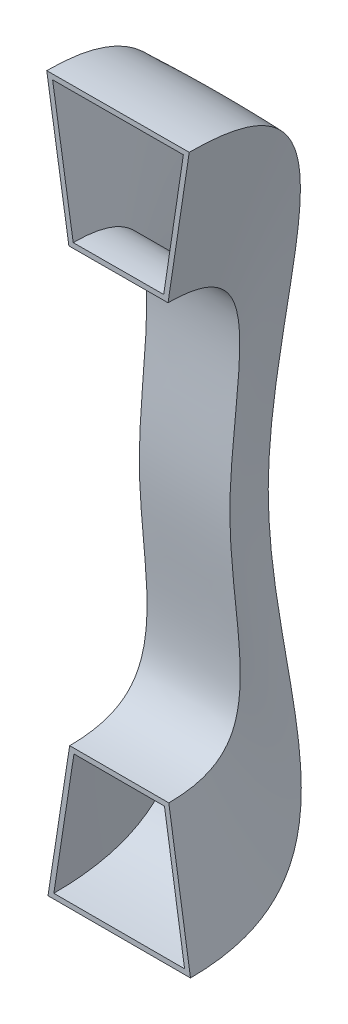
ISO-10303-21;
HEADER;
FILE_DESCRIPTION(('STEP AP214'),'2;1');
FILE_NAME('part.step','',(''),(''),'','','');
FILE_SCHEMA(('AUTOMOTIVE_DESIGN { 1 0 10303 214 1 1 1 1 }'));
ENDSEC;
DATA;
#1=APPLICATION_CONTEXT('core data for automotive mechanical design processes');
#2=APPLICATION_PROTOCOL_DEFINITION('international standard','automotive_design',2000,#1);
#3=PRODUCT_CONTEXT('',#1,'mechanical');
#4=PRODUCT('Part','Part','',(#3));
#5=PRODUCT_RELATED_PRODUCT_CATEGORY('part','',(#4));
#6=PRODUCT_DEFINITION_FORMATION('','',#4);
#7=PRODUCT_DEFINITION_CONTEXT('part definition',#1,'design');
#8=PRODUCT_DEFINITION('design','',#6,#7);
#9=PRODUCT_DEFINITION_SHAPE('','',#8);
#10=(LENGTH_UNIT() NAMED_UNIT(*) SI_UNIT(.MILLI.,.METRE.));
#11=(NAMED_UNIT(*) PLANE_ANGLE_UNIT() SI_UNIT($,.RADIAN.));
#12=(NAMED_UNIT(*) SI_UNIT($,.STERADIAN.) SOLID_ANGLE_UNIT());
#13=UNCERTAINTY_MEASURE_WITH_UNIT(LENGTH_MEASURE(1.E-05),#10,'distance_accuracy_value','');
#14=(GEOMETRIC_REPRESENTATION_CONTEXT(3) GLOBAL_UNCERTAINTY_ASSIGNED_CONTEXT((#13)) GLOBAL_UNIT_ASSIGNED_CONTEXT((#10,
#11,#12)) REPRESENTATION_CONTEXT('',''));
#15=CARTESIAN_POINT('',(0.,0.,0.));
#16=DIRECTION('',(0.,0.,1.));
#17=DIRECTION('',(1.,0.,0.));
#18=AXIS2_PLACEMENT_3D('',#15,#16,#17);
#19=CARTESIAN_POINT('',(0.,0.,0.));
#20=DIRECTION('',(0.,0.,1.));
#21=DIRECTION('',(1.,0.,0.));
#22=AXIS2_PLACEMENT_3D('',#19,#20,#21);
#23=PLANE('',#22);
#24=DIRECTION('',(0.152057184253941,0.988371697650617,0.));
#25=VECTOR('',#24,1.);
#26=CARTESIAN_POINT('',(-32.5,-175.,0.));
#27=LINE('',#26,#25);
#28=CARTESIAN_POINT('',(-32.5,-175.,0.));
#29=VERTEX_POINT('',#28);
#30=CARTESIAN_POINT('',(-22.5,-110.,0.));
#31=VERTEX_POINT('',#30);
#32=EDGE_CURVE('E163',#29,#31,#27,.T.);
#33=ORIENTED_EDGE('',*,*,#32,.T.);
#34=DIRECTION('',(1.,0.,0.));
#35=VECTOR('',#34,1.);
#36=CARTESIAN_POINT('',(22.5,-110.,0.));
#37=LINE('',#36,#35);
#38=CARTESIAN_POINT('',(22.5,-110.,0.));
#39=VERTEX_POINT('',#38);
#40=EDGE_CURVE('E177',#31,#39,#37,.T.);
#41=ORIENTED_EDGE('',*,*,#40,.T.);
#42=DIRECTION('',(0.152057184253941,-0.988371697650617,0.));
#43=VECTOR('',#42,1.);
#44=CARTESIAN_POINT('',(32.5,-175.,0.));
#45=LINE('',#44,#43);
#46=CARTESIAN_POINT('',(32.5,-175.,0.));
#47=VERTEX_POINT('',#46);
#48=EDGE_CURVE('E180',#39,#47,#45,.T.);
#49=ORIENTED_EDGE('',*,*,#48,.T.);
#50=DIRECTION('',(-1.,0.,0.));
#51=VECTOR('',#50,1.);
#52=CARTESIAN_POINT('',(-32.5,-175.,0.));
#53=LINE('',#52,#51);
#54=EDGE_CURVE('E185',#47,#29,#53,.T.);
#55=ORIENTED_EDGE('',*,*,#54,.T.);
#56=EDGE_LOOP('',(#33,#41,#49,#55));
#57=FACE_BOUND('',#56,.T.);
#58=CARTESIAN_POINT('',(-35.4140281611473,-177.5,0.));
#59=CARTESIAN_POINT('',(-34.5191671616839,-171.683403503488,0.));
#60=CARTESIAN_POINT('',(-33.6243061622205,-165.866807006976,0.));
#61=CARTESIAN_POINT('',(-31.8345841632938,-154.233614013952,0.));
#62=CARTESIAN_POINT('',(-30.9397231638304,-148.41701751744,0.));
#63=CARTESIAN_POINT('',(-29.1448513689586,-136.750350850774,0.));
#64=CARTESIAN_POINT('',(-28.2448405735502,-130.900280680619,0.));
#65=CARTESIAN_POINT('',(-26.4448189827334,-119.200140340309,0.));
#66=CARTESIAN_POINT('',(-25.5448081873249,-113.350070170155,0.));
#67=CARTESIAN_POINT('',(-24.6447973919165,-107.5,0.));
#68=B_SPLINE_CURVE_WITH_KNOTS('',3,(#58,#59,#60,#61,#62,#63,#64,#65,#66,#67),.UNSPECIFIED.,.F.,
.F.,(4,2,2,2,4),(0.,17.6550881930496,35.3101763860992,53.0668670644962,70.8235577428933),.UNSPECIFIED.);
#69=CARTESIAN_POINT('',(-35.4140281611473,-177.5,0.));
#70=VERTEX_POINT('',#69);
#71=CARTESIAN_POINT('',(-24.6447973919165,-107.5,0.));
#72=VERTEX_POINT('',#71);
#73=EDGE_CURVE('E289',#70,#72,#68,.T.);
#74=ORIENTED_EDGE('',*,*,#73,.F.);
#75=CARTESIAN_POINT('',(35.4140281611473,-177.5,0.));
#76=CARTESIAN_POINT('',(29.2455594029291,-177.5,0.));
#77=CARTESIAN_POINT('',(23.0770906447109,-177.5,0.));
#78=CARTESIAN_POINT('',(10.7401531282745,-177.5,0.));
#79=CARTESIAN_POINT('',(4.57168437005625,-177.5,0.));
#80=CARTESIAN_POINT('',(-7.23299168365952,-177.5,0.));
#81=CARTESIAN_POINT('',(-12.8691989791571,-177.5,0.));
#82=CARTESIAN_POINT('',(-24.1416135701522,-177.5,0.));
#83=CARTESIAN_POINT('',(-29.7778208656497,-177.5,0.));
#84=CARTESIAN_POINT('',(-35.4140281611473,-177.5,0.));
#85=B_SPLINE_CURVE_WITH_KNOTS('',3,(#75,#76,#77,#78,#79,#80,#81,#82,#83,#84),.UNSPECIFIED.,.F.,
.F.,(4,2,2,2,4),(0.,18.5054062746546,37.0108125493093,53.9194344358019,70.8280563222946),.UNSPECIFIED.);
#86=CARTESIAN_POINT('',(35.4140281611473,-177.5,0.));
#87=VERTEX_POINT('',#86);
#88=EDGE_CURVE('E12',#87,#70,#85,.T.);
#89=ORIENTED_EDGE('',*,*,#88,.F.);
#90=CARTESIAN_POINT('',(24.6447973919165,-107.5,0.));
#91=CARTESIAN_POINT('',(25.6064297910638,-113.750610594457,0.));
#92=CARTESIAN_POINT('',(26.568062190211,-120.001221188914,0.));
#93=CARTESIAN_POINT('',(28.4913269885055,-132.502442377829,0.));
#94=CARTESIAN_POINT('',(29.4529593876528,-138.753052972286,0.));
#95=CARTESIAN_POINT('',(32.0810705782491,-155.835775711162,0.));
#96=CARTESIAN_POINT('',(33.7475493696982,-166.667887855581,0.));
#97=CARTESIAN_POINT('',(35.4140281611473,-177.5,0.));
#98=B_SPLINE_CURVE_WITH_KNOTS('',3,(#90,#91,#92,#93,#94,#95,#96,#97),.UNSPECIFIED.,.F.,.F.,(4,2,
2,4),(0.,18.9724491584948,37.9448983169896,70.8235577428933),.UNSPECIFIED.);
#99=CARTESIAN_POINT('',(24.6447973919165,-107.5,0.));
#100=VERTEX_POINT('',#99);
#101=EDGE_CURVE('E89',#100,#87,#98,.T.);
#102=ORIENTED_EDGE('',*,*,#101,.F.);
#103=CARTESIAN_POINT('',(-24.6447973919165,-107.5,0.));
#104=CARTESIAN_POINT('',(-20.50356738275,-107.5,0.));
#105=CARTESIAN_POINT('',(-16.3623373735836,-107.5,0.));
#106=CARTESIAN_POINT('',(-8.07987735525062,-107.5,0.));
#107=CARTESIAN_POINT('',(-3.93864734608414,-107.5,0.));
#108=CARTESIAN_POINT('',(4.27628511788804,-107.5,0.));
#109=CARTESIAN_POINT('',(8.34998757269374,-107.5,0.));
#110=CARTESIAN_POINT('',(16.4973924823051,-107.5,0.));
#111=CARTESIAN_POINT('',(20.5710949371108,-107.5,0.));
#112=CARTESIAN_POINT('',(24.6447973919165,-107.5,0.));
#113=B_SPLINE_CURVE_WITH_KNOTS('',3,(#103,#104,#105,#106,#107,#108,#109,#110,#111,#112),
.UNSPECIFIED.,.F.,.F.,(4,2,2,2,4),(0.,12.4236900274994,24.8473800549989,37.068487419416,
49.289594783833),.UNSPECIFIED.);
#114=EDGE_CURVE('E297',#72,#100,#113,.T.);
#115=ORIENTED_EDGE('',*,*,#114,.F.);
#116=EDGE_LOOP('',(#74,#89,#102,#115));
#117=FACE_BOUND('',#116,.T.);
#118=ADVANCED_FACE('F78',(#57,#117),#23,.T.);
#119=CARTESIAN_POINT('',(0.,0.,0.));
#120=DIRECTION('',(0.,0.,1.));
#121=DIRECTION('',(1.,0.,0.));
#122=AXIS2_PLACEMENT_3D('',#119,#120,#121);
#123=PLANE('',#122);
#124=DIRECTION('',(0.155506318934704,-0.987834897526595,0.));
#125=VECTOR('',#124,1.);
#126=CARTESIAN_POINT('',(-33.1106690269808,174.886355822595,0.));
#127=LINE('',#126,#125);
#128=CARTESIAN_POINT('',(-33.1106690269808,174.886355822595,0.));
#129=VERTEX_POINT('',#128);
#130=CARTESIAN_POINT('',(-22.8838376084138,109.921658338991,0.));
#131=VERTEX_POINT('',#130);
#132=EDGE_CURVE('E160',#129,#131,#127,.T.);
#133=ORIENTED_EDGE('',*,*,#132,.F.);
#134=DIRECTION('',(-0.99999390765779,-0.0034906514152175,0.));
#135=VECTOR('',#134,1.);
#136=CARTESIAN_POINT('',(31.8889349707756,175.113248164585,0.));
#137=LINE('',#136,#135);
#138=CARTESIAN_POINT('',(31.8889349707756,175.113248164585,0.));
#139=VERTEX_POINT('',#138);
#140=EDGE_CURVE('E147',#139,#129,#137,.T.);
#141=ORIENTED_EDGE('',*,*,#140,.F.);
#142=DIRECTION('',(0.148606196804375,0.988896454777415,0.));
#143=VECTOR('',#142,1.);
#144=CARTESIAN_POINT('',(31.8889349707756,175.113248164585,0.));
#145=LINE('',#144,#143);
#146=CARTESIAN_POINT('',(22.1158882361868,110.078737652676,0.));
#147=VERTEX_POINT('',#146);
#148=EDGE_CURVE('E104',#147,#139,#145,.T.);
#149=ORIENTED_EDGE('',*,*,#148,.F.);
#150=DIRECTION('',(0.99999390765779,0.00349065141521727,0.));
#151=VECTOR('',#150,1.);
#152=CARTESIAN_POINT('',(-22.8838376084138,109.921658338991,0.));
#153=LINE('',#152,#151);
#154=EDGE_CURVE('E169',#131,#147,#153,.T.);
#155=ORIENTED_EDGE('',*,*,#154,.F.);
#156=EDGE_LOOP('',(#133,#141,#149,#155));
#157=FACE_BOUND('',#156,.T.);
#158=CARTESIAN_POINT('',(-36.0334060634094,177.376168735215,0.));
#159=CARTESIAN_POINT('',(-35.1182468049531,171.562731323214,0.));
#160=CARTESIAN_POINT('',(-34.2030875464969,165.749293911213,0.));
#161=CARTESIAN_POINT('',(-32.3727690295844,154.12241908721,0.));
#162=CARTESIAN_POINT('',(-31.4576097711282,148.308981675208,0.));
#163=CARTESIAN_POINT('',(-29.6220246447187,136.648651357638,0.));
#164=CARTESIAN_POINT('',(-28.7015987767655,130.80175845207,0.));
#165=CARTESIAN_POINT('',(-26.860747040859,119.107972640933,0.));
#166=CARTESIAN_POINT('',(-25.9403211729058,113.261079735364,0.));
#167=CARTESIAN_POINT('',(-25.0198953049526,107.414186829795,0.));
#168=B_SPLINE_CURVE_WITH_KNOTS('',3,(#158,#159,#160,#161,#162,#163,#164,#165,#166,#167),
.UNSPECIFIED.,.F.,.F.,(4,2,2,2,4),(0.,17.6550881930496,35.3101763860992,53.0668670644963,
70.8235577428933),.UNSPECIFIED.);
#169=CARTESIAN_POINT('',(-36.0334060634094,177.376168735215,0.));
#170=VERTEX_POINT('',#169);
#171=CARTESIAN_POINT('',(-25.0198953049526,107.414186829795,0.));
#172=VERTEX_POINT('',#171);
#173=EDGE_CURVE('E189',#170,#172,#168,.T.);
#174=ORIENTED_EDGE('',*,*,#173,.T.);
#175=CARTESIAN_POINT('',(-25.0198953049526,107.414186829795,0.));
#176=CARTESIAN_POINT('',(-20.8786905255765,107.428642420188,0.));
#177=CARTESIAN_POINT('',(-16.7374857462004,107.44309801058,0.));
#178=CARTESIAN_POINT('',(-8.45507618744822,107.472009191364,0.));
#179=CARTESIAN_POINT('',(-4.31387140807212,107.486464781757,0.));
#180=CARTESIAN_POINT('',(3.90101100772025,107.515140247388,0.));
#181=CARTESIAN_POINT('',(7.97468864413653,107.529360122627,0.));
#182=CARTESIAN_POINT('',(16.1220439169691,107.557799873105,0.));
#183=CARTESIAN_POINT('',(20.1957215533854,107.572019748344,0.));
#184=CARTESIAN_POINT('',(24.2693991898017,107.586239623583,0.));
#185=B_SPLINE_CURVE_WITH_KNOTS('',3,(#175,#176,#177,#178,#179,#180,#181,#182,#183,#184),
.UNSPECIFIED.,.F.,.F.,(4,2,2,2,4),(0.,12.4236900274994,24.8473800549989,37.0684874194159,
49.289594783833),.UNSPECIFIED.);
#186=CARTESIAN_POINT('',(24.2693991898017,107.586239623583,0.));
#187=VERTEX_POINT('',#186);
#188=EDGE_CURVE('E339',#172,#187,#185,.T.);
#189=ORIENTED_EDGE('',*,*,#188,.T.);
#190=CARTESIAN_POINT('',(24.2693991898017,107.586239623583,0.));
#191=CARTESIAN_POINT('',(25.2092070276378,113.840168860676,0.));
#192=CARTESIAN_POINT('',(26.1490148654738,120.09409809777,0.));
#193=CARTESIAN_POINT('',(28.028630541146,132.601956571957,0.));
#194=CARTESIAN_POINT('',(28.9684383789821,138.85588580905,0.));
#195=CARTESIAN_POINT('',(31.5369037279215,155.94767829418,0.));
#196=CARTESIAN_POINT('',(33.1655612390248,166.785541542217,0.));
#197=CARTESIAN_POINT('',(34.7942187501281,177.623404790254,0.));
#198=B_SPLINE_CURVE_WITH_KNOTS('',3,(#190,#191,#192,#193,#194,#195,#196,#197),.UNSPECIFIED.,.F.,
.F.,(4,2,2,4),(0.,18.9724491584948,37.9448983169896,70.8235577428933),.UNSPECIFIED.);
#199=CARTESIAN_POINT('',(34.7942187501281,177.623404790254,0.));
#200=VERTEX_POINT('',#199);
#201=EDGE_CURVE('E346',#187,#200,#198,.T.);
#202=ORIENTED_EDGE('',*,*,#201,.T.);
#203=CARTESIAN_POINT('',(34.7942187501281,177.623404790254,0.));
#204=CARTESIAN_POINT('',(28.6257875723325,177.601872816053,0.));
#205=CARTESIAN_POINT('',(22.4573563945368,177.580340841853,0.));
#206=CARTESIAN_POINT('',(10.1204940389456,177.537276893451,0.));
#207=CARTESIAN_POINT('',(3.95206286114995,177.515744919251,0.));
#208=CARTESIAN_POINT('',(-7.85254127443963,177.474538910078,0.));
#209=CARTESIAN_POINT('',(-13.4887142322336,177.454864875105,0.));
#210=CARTESIAN_POINT('',(-24.7610601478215,177.41551680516,0.));
#211=CARTESIAN_POINT('',(-30.3972331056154,177.395842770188,0.));
#212=CARTESIAN_POINT('',(-36.0334060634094,177.376168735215,0.));
#213=B_SPLINE_CURVE_WITH_KNOTS('',3,(#203,#204,#205,#206,#207,#208,#209,#210,#211,#212),
.UNSPECIFIED.,.F.,.F.,(4,2,2,2,4),(0.,18.5054062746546,37.0108125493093,53.9194344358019,
70.8280563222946),.UNSPECIFIED.);
#214=EDGE_CURVE('E357',#200,#170,#213,.T.);
#215=ORIENTED_EDGE('',*,*,#214,.T.);
#216=EDGE_LOOP('',(#174,#189,#202,#215));
#217=FACE_BOUND('',#216,.T.);
#218=ADVANCED_FACE('F167',(#157,#217),#123,.T.);
#219=CARTESIAN_POINT('',(25.3868772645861,110.090155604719,0.));
#220=CARTESIAN_POINT('',(25.3868772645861,110.090155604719,-57.7707323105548));
#221=CARTESIAN_POINT('',(20.2361828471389,-0.0444612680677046,-12.2710977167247));
#222=CARTESIAN_POINT('',(25.7710089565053,-110.,-57.7322274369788));
#223=CARTESIAN_POINT('',(25.7710089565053,-110.,0.));
#224=CARTESIAN_POINT('',(24.296547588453,110.086349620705,0.));
#225=CARTESIAN_POINT('',(24.296547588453,110.086349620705,-57.7691208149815));
#226=CARTESIAN_POINT('',(19.3881401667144,-0.0425582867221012,-12.2719034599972));
#227=CARTESIAN_POINT('',(24.6806726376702,-110.,-57.7322274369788));
#228=CARTESIAN_POINT('',(24.6806726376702,-110.,0.));
#229=CARTESIAN_POINT('',(23.2062179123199,110.082543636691,0.));
#230=CARTESIAN_POINT('',(23.2062179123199,110.082543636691,-57.7675093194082));
#231=CARTESIAN_POINT('',(18.54009748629,-0.0406553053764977,-12.2727092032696));
#232=CARTESIAN_POINT('',(23.5903363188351,-110.,-57.7322274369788));
#233=CARTESIAN_POINT('',(23.5903363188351,-110.,0.));
#234=CARTESIAN_POINT('',(7.11597962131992,110.026377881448,0.));
#235=CARTESIAN_POINT('',(7.11597962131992,110.026377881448,-57.7437281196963));
#236=CARTESIAN_POINT('',(6.02534244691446,-0.0125725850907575,-12.2845997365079));
#237=CARTESIAN_POINT('',(7.5,-110.,-57.7322274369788));
#238=CARTESIAN_POINT('',(7.5,-110.,0.));
#239=CARTESIAN_POINT('',(-7.88392899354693,109.97401811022,0.));
#240=CARTESIAN_POINT('',(-7.88392899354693,109.97401811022,-57.7215584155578));
#241=CARTESIAN_POINT('',(-5.64136991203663,0.0136071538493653,-12.2956845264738));
#242=CARTESIAN_POINT('',(-7.49999999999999,-110.,-57.7322274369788));
#243=CARTESIAN_POINT('',(-7.49999999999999,-110.,0.));
#244=CARTESIAN_POINT('',(-23.9731272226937,109.917855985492,0.));
#245=CARTESIAN_POINT('',(-23.9731272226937,109.917855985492,-57.6977787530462));
#246=CARTESIAN_POINT('',(-18.1553160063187,0.041688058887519,-12.3075742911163));
#247=CARTESIAN_POINT('',(-23.5892962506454,-110.,-57.7322274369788));
#248=CARTESIAN_POINT('',(-23.5892962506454,-110.,0.));
#249=CARTESIAN_POINT('',(-25.0624168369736,109.914053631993,0.));
#250=CARTESIAN_POINT('',(-25.0624168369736,109.914053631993,-57.6961687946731));
#251=CARTESIAN_POINT('',(-19.0025497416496,0.043589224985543,-12.3083792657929));
#252=CARTESIAN_POINT('',(-24.6785925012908,-110.,-57.7322274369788));
#253=CARTESIAN_POINT('',(-24.6785925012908,-110.,0.));
#254=CARTESIAN_POINT('',(-26.1517064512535,109.910251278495,0.));
#255=CARTESIAN_POINT('',(-26.1517064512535,109.910251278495,-57.6945588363));
#256=CARTESIAN_POINT('',(-19.8497834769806,0.045490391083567,-12.3091842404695));
#257=CARTESIAN_POINT('',(-25.7678887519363,-110.,-57.7322274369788));
#258=CARTESIAN_POINT('',(-25.7678887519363,-110.,0.));
#259=B_SPLINE_SURFACE_WITH_KNOTS('',3,3,((#219,#220,#221,#222,#223),(#224,#225,#226,#227,#228),
(#229,#230,#231,#232,#233),(#234,#235,#236,#237,#238),(#239,#240,#241,#242,#243),(#244,#245,
#246,#247,#248),(#249,#250,#251,#252,#253),(#254,#255,#256,#257,#258)),.UNSPECIFIED.,.F.,.F.,
.F.,(4,2,2,4),(4,1,4),(-0.0726890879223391,0.,1.,1.07261975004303),(0.,0.500001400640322,1.),.UNSPECIFIED.);
#260=OFFSET_SURFACE('',#259,2.5,.F.);
#261=ORIENTED_EDGE('',*,*,#188,.F.);
#262=CARTESIAN_POINT('',(-25.0198953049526,107.414186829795,0.));
#263=CARTESIAN_POINT('',(-25.0198936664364,107.414152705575,-0.667677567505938));
#264=CARTESIAN_POINT('',(-25.0195451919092,107.406619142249,-1.33539775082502));
#265=CARTESIAN_POINT('',(-25.0180806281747,107.374899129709,-2.67277423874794));
#266=CARTESIAN_POINT('',(-25.0169618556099,107.350654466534,-3.34242913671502));
#267=CARTESIAN_POINT('',(-25.0138787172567,107.283769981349,-4.68216275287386));
#268=CARTESIAN_POINT('',(-25.0119126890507,107.241093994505,-5.35223970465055));
#269=CARTESIAN_POINT('',(-25.007047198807,107.135407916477,-6.69126461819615));
#270=CARTESIAN_POINT('',(-25.0041470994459,107.072383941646,-7.36021149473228));
#271=CARTESIAN_POINT('',(-24.9972321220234,106.922056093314,-8.71202444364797));
#272=CARTESIAN_POINT('',(-24.9931916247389,106.834194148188,-9.3948290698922));
#273=CARTESIAN_POINT('',(-24.9839114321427,106.632394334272,-10.7560247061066));
#274=CARTESIAN_POINT('',(-24.978672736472,106.518478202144,-11.4344189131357));
#275=CARTESIAN_POINT('',(-24.9668622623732,106.261767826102,-12.7850883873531));
#276=CARTESIAN_POINT('',(-24.9602917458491,106.119000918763,-13.457368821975));
#277=CARTESIAN_POINT('',(-24.9456624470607,105.801414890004,-14.7940781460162));
#278=CARTESIAN_POINT('',(-24.9376043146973,105.626609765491,-15.4585103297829));
#279=CARTESIAN_POINT('',(-24.9222404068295,105.293794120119,-16.5980501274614));
#280=CARTESIAN_POINT('',(-24.915324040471,105.14410247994,-17.0755971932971));
#281=CARTESIAN_POINT('',(-24.9005388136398,104.824517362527,-18.0239367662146));
#282=CARTESIAN_POINT('',(-24.8926698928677,104.654622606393,-18.4947288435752));
#283=CARTESIAN_POINT('',(-24.8759084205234,104.293295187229,-19.4280133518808));
#284=CARTESIAN_POINT('',(-24.8670158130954,104.101861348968,-19.8905053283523));
#285=CARTESIAN_POINT('',(-24.8481970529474,103.697470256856,-20.8025396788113));
#286=CARTESIAN_POINT('',(-24.8382776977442,103.484654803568,-21.2521448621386));
#287=CARTESIAN_POINT('',(-24.8172987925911,103.035441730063,-22.1394273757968));
#288=CARTESIAN_POINT('',(-24.8062392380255,102.79904401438,-22.577104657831));
#289=CARTESIAN_POINT('',(-24.7829312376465,102.301851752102,-23.4383814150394));
#290=CARTESIAN_POINT('',(-24.7706827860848,102.041057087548,-23.8619808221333));
#291=CARTESIAN_POINT('',(-24.7447832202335,101.490700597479,-24.6988024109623));
#292=CARTESIAN_POINT('',(-24.7311144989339,101.200779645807,-25.1117884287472));
#293=CARTESIAN_POINT('',(-24.7025208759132,100.595385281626,-25.9186048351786));
#294=CARTESIAN_POINT('',(-24.687595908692,100.279910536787,-26.3124342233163));
#295=CARTESIAN_POINT('',(-24.6565250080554,99.6240563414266,-27.0786648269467));
#296=CARTESIAN_POINT('',(-24.640379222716,99.283679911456,-27.4510686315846));
#297=CARTESIAN_POINT('',(-24.6069231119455,98.5788971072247,-28.172899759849));
#298=CARTESIAN_POINT('',(-24.5896119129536,98.2144727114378,-28.5223094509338));
#299=CARTESIAN_POINT('',(-24.5539414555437,97.4634850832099,-29.1964870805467));
#300=CARTESIAN_POINT('',(-24.5355820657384,97.0769190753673,-29.5212519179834));
#301=CARTESIAN_POINT('',(-24.4979549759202,96.283786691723,-30.1452731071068));
#302=CARTESIAN_POINT('',(-24.4786872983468,95.8772208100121,-30.4445300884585));
#303=CARTESIAN_POINT('',(-24.4432775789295,95.1283783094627,-30.9608297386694));
#304=CARTESIAN_POINT('',(-24.4272683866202,94.789233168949,-31.1824480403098));
#305=CARTESIAN_POINT('',(-24.3948516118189,94.1007576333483,-31.6093004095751));
#306=CARTESIAN_POINT('',(-24.3784439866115,93.7514261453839,-31.8145327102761));
#307=CARTESIAN_POINT('',(-24.345319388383,93.0438390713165,-32.2089257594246));
#308=CARTESIAN_POINT('',(-24.3286024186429,92.6855835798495,-32.39808667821));
#309=CARTESIAN_POINT('',(-24.2949422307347,91.9612792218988,-32.7608658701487));
#310=CARTESIAN_POINT('',(-24.2779989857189,91.5952294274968,-32.9344822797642));
#311=CARTESIAN_POINT('',(-24.2269121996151,90.4861702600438,-33.4333122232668));
#312=CARTESIAN_POINT('',(-24.1925466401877,89.7329967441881,-33.7360958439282));
#313=CARTESIAN_POINT('',(-24.1238121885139,88.2074175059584,-34.2876124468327));
#314=CARTESIAN_POINT('',(-24.0894432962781,87.4350118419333,-34.5363455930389));
#315=CARTESIAN_POINT('',(-24.0295524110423,86.0683350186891,-34.9307755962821));
#316=CARTESIAN_POINT('',(-24.0039343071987,85.4769946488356,-35.0867661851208));
#317=CARTESIAN_POINT('',(-23.9530980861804,84.2883326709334,-35.3742673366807));
#318=CARTESIAN_POINT('',(-23.9278800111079,83.6910104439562,-35.5057753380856));
#319=CARTESIAN_POINT('',(-23.8779383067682,82.4911621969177,-35.7468996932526));
#320=CARTESIAN_POINT('',(-23.8532153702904,81.8886303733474,-35.8564870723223));
#321=CARTESIAN_POINT('',(-23.8043964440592,80.6803108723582,-36.0558182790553));
#322=CARTESIAN_POINT('',(-23.7803004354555,80.0745232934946,-36.1455627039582));
#323=CARTESIAN_POINT('',(-23.7327944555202,78.8601557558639,-36.3073263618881));
#324=CARTESIAN_POINT('',(-23.709384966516,78.2515741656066,-36.3793333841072));
#325=CARTESIAN_POINT('',(-23.6633271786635,77.0327188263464,-36.5074025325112));
#326=CARTESIAN_POINT('',(-23.6406788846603,76.4224450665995,-36.5634645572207));
#327=CARTESIAN_POINT('',(-23.5960038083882,75.1957193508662,-36.6617148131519));
#328=CARTESIAN_POINT('',(-23.573983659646,74.5792578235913,-36.7037852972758));
#329=CARTESIAN_POINT('',(-23.5307913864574,73.3455538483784,-36.7749482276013));
#330=CARTESIAN_POINT('',(-23.5096192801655,72.728311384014,-36.8040403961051));
#331=CARTESIAN_POINT('',(-23.4681639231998,71.4939718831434,-36.8505962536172));
#332=CARTESIAN_POINT('',(-23.4478798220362,70.8768752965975,-36.8680713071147));
#333=CARTESIAN_POINT('',(-23.4081889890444,69.6424576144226,-36.8926597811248));
#334=CARTESIAN_POINT('',(-23.3887822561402,69.0251365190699,-36.8997732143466));
#335=CARTESIAN_POINT('',(-23.3318987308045,67.1735743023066,-36.9072522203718));
#336=CARTESIAN_POINT('',(-23.2957416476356,65.9392290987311,-36.8937736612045));
#337=CARTESIAN_POINT('',(-23.2239844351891,63.3667312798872,-36.8350984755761));
#338=CARTESIAN_POINT('',(-23.1886905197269,62.0286358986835,-36.7873135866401));
#339=CARTESIAN_POINT('',(-23.1220052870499,59.3535295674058,-36.6650705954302));
#340=CARTESIAN_POINT('',(-23.0906142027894,58.0165186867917,-36.5906109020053));
#341=CARTESIAN_POINT('',(-23.031468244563,55.3431574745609,-36.4214509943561));
#342=CARTESIAN_POINT('',(-23.0037149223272,54.0068076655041,-36.3267421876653));
#343=CARTESIAN_POINT('',(-22.9515512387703,51.3352181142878,-36.1225505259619));
#344=CARTESIAN_POINT('',(-22.9271408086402,49.9999783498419,-36.0130679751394));
#345=CARTESIAN_POINT('',(-22.8813056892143,47.3292988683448,-35.783910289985));
#346=CARTESIAN_POINT('',(-22.8598833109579,45.9938597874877,-35.6642273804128));
#347=CARTESIAN_POINT('',(-22.8196984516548,43.3234956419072,-35.41883888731));
#348=CARTESIAN_POINT('',(-22.8009359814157,41.9885705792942,-35.293133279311));
#349=CARTESIAN_POINT('',(-22.7657273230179,39.318394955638,-35.0393094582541));
#350=CARTESIAN_POINT('',(-22.7492820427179,37.9831444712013,-34.9111903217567));
#351=CARTESIAN_POINT('',(-22.7184082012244,35.3125298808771,-34.6559234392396));
#352=CARTESIAN_POINT('',(-22.7039796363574,33.9771657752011,-34.5287756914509));
#353=CARTESIAN_POINT('',(-22.6768739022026,31.3061713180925,-34.278560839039));
#354=CARTESIAN_POINT('',(-22.6641965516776,29.9705410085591,-34.1554933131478));
#355=CARTESIAN_POINT('',(-22.6403826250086,27.2986430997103,-33.9163479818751));
#356=CARTESIAN_POINT('',(-22.6292460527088,25.9623754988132,-33.8002701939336));
#357=CARTESIAN_POINT('',(-22.5979052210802,21.9534600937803,-33.4668448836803));
#358=CARTESIAN_POINT('',(-22.5797580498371,19.2795061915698,-33.2641884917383));
#359=CARTESIAN_POINT('',(-22.5563166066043,15.2761657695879,-33.0066170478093));
#360=CARTESIAN_POINT('',(-22.5491538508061,13.9482712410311,-32.9287152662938));
#361=CARTESIAN_POINT('',(-22.5360706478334,11.2915382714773,-32.7905501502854));
#362=CARTESIAN_POINT('',(-22.5301502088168,9.96269982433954,-32.730286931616));
#363=CARTESIAN_POINT('',(-22.5195940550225,7.30422508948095,-32.6300648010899));
#364=CARTESIAN_POINT('',(-22.5149583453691,5.97458879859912,-32.5901059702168));
#365=CARTESIAN_POINT('',(-22.5090227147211,3.97978066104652,-32.5474411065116));
#366=CARTESIAN_POINT('',(-22.5072138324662,3.31478855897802,-32.5360983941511));
#367=CARTESIAN_POINT('',(-22.5039449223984,1.98472648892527,-32.5194969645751));
#368=CARTESIAN_POINT('',(-22.5024848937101,1.31965652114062,-32.5142382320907));
#369=CARTESIAN_POINT('',(-22.4999258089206,-0.0105372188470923,-32.5102266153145));
#370=CARTESIAN_POINT('',(-22.4988267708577,-0.675660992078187,-32.5114740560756));
#371=CARTESIAN_POINT('',(-22.4969859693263,-2.00586685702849,-32.520335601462));
#372=CARTESIAN_POINT('',(-22.4962442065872,-2.67094894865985,-32.5279497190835));
#373=CARTESIAN_POINT('',(-22.4951065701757,-4.00102778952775,-32.5491473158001));
#374=CARTESIAN_POINT('',(-22.4947107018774,-4.66602453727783,-32.5627308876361));
#375=CARTESIAN_POINT('',(-22.4942556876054,-5.99587683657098,-32.5955372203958));
#376=CARTESIAN_POINT('',(-22.4941965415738,-6.66073238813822,-32.6147599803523));
#377=CARTESIAN_POINT('',(-22.4945103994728,-8.65562836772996,-32.6803908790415));
#378=CARTESIAN_POINT('',(-22.4953751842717,-9.9854122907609,-32.7347517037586));
#379=CARTESIAN_POINT('',(-22.4983603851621,-12.6440674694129,-32.8619866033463));
#380=CARTESIAN_POINT('',(-22.5004807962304,-13.972938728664,-32.9348606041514));
#381=CARTESIAN_POINT('',(-22.5059556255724,-16.6300763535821,-33.0964894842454));
#382=CARTESIAN_POINT('',(-22.50931038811,-17.9583424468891,-33.1852487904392));
#383=CARTESIAN_POINT('',(-22.5172748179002,-20.6139131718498,-33.3759873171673));
#384=CARTESIAN_POINT('',(-22.5218844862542,-21.9412178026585,-33.4779665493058));
#385=CARTESIAN_POINT('',(-22.5324289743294,-24.5943259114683,-33.6924273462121));
#386=CARTESIAN_POINT('',(-22.5383631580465,-25.9201298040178,-33.8049038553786));
#387=CARTESIAN_POINT('',(-22.5516866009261,-28.5710430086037,-34.0376878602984));
#388=CARTESIAN_POINT('',(-22.5590758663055,-29.8961523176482,-34.1579953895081));
#389=CARTESIAN_POINT('',(-22.5722715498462,-32.0254436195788,-34.3553828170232));
#390=CARTESIAN_POINT('',(-22.5775594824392,-32.8297769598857,-34.4308785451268));
#391=CARTESIAN_POINT('',(-22.5887917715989,-34.438139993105,-34.5830470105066));
#392=CARTESIAN_POINT('',(-22.5947359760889,-35.2421697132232,-34.6597194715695));
#393=CARTESIAN_POINT('',(-22.6073386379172,-36.850057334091,-34.813570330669));
#394=CARTESIAN_POINT('',(-22.613996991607,-37.6539152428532,-34.8907486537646));
#395=CARTESIAN_POINT('',(-22.6280920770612,-39.2615943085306,-35.0449104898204));
#396=CARTESIAN_POINT('',(-22.6355287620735,-40.065415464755,-35.1218940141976));
#397=CARTESIAN_POINT('',(-22.6512496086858,-41.6731593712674,-35.2749299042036));
#398=CARTESIAN_POINT('',(-22.6595337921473,-42.4770821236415,-35.3509822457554));
#399=CARTESIAN_POINT('',(-22.6770430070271,-44.0870386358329,-35.5015504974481));
#400=CARTESIAN_POINT('',(-22.6862702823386,-44.8930727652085,-35.5760622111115));
#401=CARTESIAN_POINT('',(-22.7057245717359,-46.505417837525,-35.722517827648));
#402=CARTESIAN_POINT('',(-22.7159516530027,-47.3117287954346,-35.7944615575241));
#403=CARTESIAN_POINT('',(-22.7374812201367,-48.9246596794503,-35.9348702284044));
#404=CARTESIAN_POINT('',(-22.7487837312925,-49.7312796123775,-36.0033350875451));
#405=CARTESIAN_POINT('',(-22.7725391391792,-51.3448670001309,-36.1358023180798));
#406=CARTESIAN_POINT('',(-22.7849920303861,-52.15183445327,-36.1998047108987));
#407=CARTESIAN_POINT('',(-22.8111209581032,-53.766162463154,-36.3222763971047));
#408=CARTESIAN_POINT('',(-22.8247969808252,-54.5735230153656,-36.3807457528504));
#409=CARTESIAN_POINT('',(-22.8547757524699,-56.2639347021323,-36.4961149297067));
#410=CARTESIAN_POINT('',(-22.871204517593,-57.1470286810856,-36.5523608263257));
#411=CARTESIAN_POINT('',(-22.9056880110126,-58.9137499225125,-36.6551350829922));
#412=CARTESIAN_POINT('',(-22.9237427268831,-59.7973771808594,-36.7016635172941));
#413=CARTESIAN_POINT('',(-22.961549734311,-61.5651890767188,-36.7830851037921));
#414=CARTESIAN_POINT('',(-22.9813021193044,-62.4493737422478,-36.8179776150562));
#415=CARTESIAN_POINT('',(-23.0225638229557,-64.21833798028,-36.8739487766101));
#416=CARTESIAN_POINT('',(-23.0440735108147,-65.1031176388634,-36.8950245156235));
#417=CARTESIAN_POINT('',(-23.0888755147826,-66.8725606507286,-36.9208467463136));
#418=CARTESIAN_POINT('',(-23.1121671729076,-67.7572239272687,-36.9255992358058));
#419=CARTESIAN_POINT('',(-23.1605547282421,-69.5264103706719,-36.9159123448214));
#420=CARTESIAN_POINT('',(-23.1856506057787,-70.4109335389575,-36.9014731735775));
#421=CARTESIAN_POINT('',(-23.2376268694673,-72.1790757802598,-36.8500644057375));
#422=CARTESIAN_POINT('',(-23.2645068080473,-73.0626950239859,-36.8131004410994));
#423=CARTESIAN_POINT('',(-23.32000530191,-74.8282906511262,-36.7127567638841));
#424=CARTESIAN_POINT('',(-23.3486235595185,-75.710267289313,-36.6493815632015));
#425=CARTESIAN_POINT('',(-23.3954060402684,-77.1094646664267,-36.5240517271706));
#426=CARTESIAN_POINT('',(-23.4130327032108,-77.6276172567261,-36.4722184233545));
#427=CARTESIAN_POINT('',(-23.4488287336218,-78.6625780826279,-36.3567294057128));
#428=CARTESIAN_POINT('',(-23.466998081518,-79.1793863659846,-36.2930741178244));
#429=CARTESIAN_POINT('',(-23.5038481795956,-80.2113361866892,-36.1527699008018));
#430=CARTESIAN_POINT('',(-23.522529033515,-80.726477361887,-36.0761183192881));
#431=CARTESIAN_POINT('',(-23.5603523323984,-81.7544006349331,-35.9085696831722));
#432=CARTESIAN_POINT('',(-23.5794947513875,-82.2671828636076,-35.8176734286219));
#433=CARTESIAN_POINT('',(-23.618168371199,-83.289245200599,-35.6203518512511));
#434=CARTESIAN_POINT('',(-23.6376991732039,-83.79852824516,-35.5139418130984));
#435=CARTESIAN_POINT('',(-23.677096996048,-84.8131939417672,-35.2840646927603));
#436=CARTESIAN_POINT('',(-23.6969640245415,-85.3185765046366,-35.1605972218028));
#437=CARTESIAN_POINT('',(-23.7569411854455,-86.8271082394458,-34.7623285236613));
#438=CARTESIAN_POINT('',(-23.7974486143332,-87.8232000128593,-34.4595569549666));
#439=CARTESIAN_POINT('',(-23.8668371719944,-89.4995052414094,-33.8672143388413));
#440=CARTESIAN_POINT('',(-23.8956775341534,-90.1874258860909,-33.5993564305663));
#441=CARTESIAN_POINT('',(-23.9530551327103,-91.5425249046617,-33.0149257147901));
#442=CARTESIAN_POINT('',(-23.9815923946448,-92.209705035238,-32.6983570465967));
#443=CARTESIAN_POINT('',(-24.0237917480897,-93.189239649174,-32.1845821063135));
#444=CARTESIAN_POINT('',(-24.0377464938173,-93.5119692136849,-32.006989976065));
#445=CARTESIAN_POINT('',(-24.065402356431,-94.1496982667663,-31.6384378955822));
#446=CARTESIAN_POINT('',(-24.0791035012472,-94.4646986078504,-31.4474794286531));
#447=CARTESIAN_POINT('',(-24.1061920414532,-95.0860916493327,-31.051944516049));
#448=CARTESIAN_POINT('',(-24.1195794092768,-95.392483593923,-30.8473668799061));
#449=CARTESIAN_POINT('',(-24.1459767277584,-95.9956740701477,-30.4245562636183));
#450=CARTESIAN_POINT('',(-24.1589867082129,-96.2924733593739,-30.2063243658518));
#451=CARTESIAN_POINT('',(-24.18900564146,-96.9766486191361,-29.6782656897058));
#452=CARTESIAN_POINT('',(-24.2058385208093,-97.3597816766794,-29.3628992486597));
#453=CARTESIAN_POINT('',(-24.2385896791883,-98.1050420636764,-28.7081598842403));
#454=CARTESIAN_POINT('',(-24.2545078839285,-98.467167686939,-28.3687850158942));
#455=CARTESIAN_POINT('',(-24.285325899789,-99.1686696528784,-27.6673143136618));
#456=CARTESIAN_POINT('',(-24.3002258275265,-99.5080486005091,-27.3052210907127));
#457=CARTESIAN_POINT('',(-24.3289430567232,-100.162963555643,-26.5598878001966));
#458=CARTESIAN_POINT('',(-24.342760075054,-100.478493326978,-26.1766422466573));
#459=CARTESIAN_POINT('',(-24.3692726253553,-101.084964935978,-25.3910873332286));
#460=CARTESIAN_POINT('',(-24.3819680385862,-101.375904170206,-24.988775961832));
#461=CARTESIAN_POINT('',(-24.4062314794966,-101.933019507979,-24.167348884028));
#462=CARTESIAN_POINT('',(-24.417799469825,-102.199194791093,-23.7482326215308));
#463=CARTESIAN_POINT('',(-24.4416842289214,-102.749873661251,-22.8236567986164));
#464=CARTESIAN_POINT('',(-24.4537993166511,-103.029921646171,-22.3155377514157));
#465=CARTESIAN_POINT('',(-24.476589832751,-103.557905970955,-21.2828036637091));
#466=CARTESIAN_POINT('',(-24.487264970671,-103.805835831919,-20.7581853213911));
#467=CARTESIAN_POINT('',(-24.507265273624,-104.271255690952,-19.6956002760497));
#468=CARTESIAN_POINT('',(-24.5165903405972,-104.488743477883,-19.1576326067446));
#469=CARTESIAN_POINT('',(-24.5340465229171,-104.896540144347,-18.0676097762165));
#470=CARTESIAN_POINT('',(-24.5421696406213,-105.086666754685,-17.5154866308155));
#471=CARTESIAN_POINT('',(-24.5572546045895,-105.440194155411,-16.4028635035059));
#472=CARTESIAN_POINT('',(-24.5642166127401,-105.603598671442,-15.842364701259));
#473=CARTESIAN_POINT('',(-24.5770817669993,-105.905835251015,-14.7148302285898));
#474=CARTESIAN_POINT('',(-24.5829849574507,-106.044668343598,-14.1477948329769));
#475=CARTESIAN_POINT('',(-24.5937516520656,-106.298032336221,-13.0166280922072));
#476=CARTESIAN_POINT('',(-24.5986284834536,-106.412874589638,-12.4525661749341));
#477=CARTESIAN_POINT('',(-24.6075274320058,-106.622492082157,-11.3206920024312));
#478=CARTESIAN_POINT('',(-24.6115494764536,-106.717265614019,-10.752879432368));
#479=CARTESIAN_POINT('',(-24.6188140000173,-106.888448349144,-9.6142921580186));
#480=CARTESIAN_POINT('',(-24.6220561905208,-106.964850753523,-9.04351643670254));
#481=CARTESIAN_POINT('',(-24.6278266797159,-107.100806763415,-7.89976234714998));
#482=CARTESIAN_POINT('',(-24.630354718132,-107.160354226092,-7.32678325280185));
#483=CARTESIAN_POINT('',(-24.6347090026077,-107.262880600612,-6.19133973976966));
#484=CARTESIAN_POINT('',(-24.6365487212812,-107.306177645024,-5.6289038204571));
#485=CARTESIAN_POINT('',(-24.6396480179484,-107.379082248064,-4.50331276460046));
#486=CARTESIAN_POINT('',(-24.640907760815,-107.408693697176,-3.94015787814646));
#487=CARTESIAN_POINT('',(-24.6428913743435,-107.455293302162,-2.81383155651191));
#488=CARTESIAN_POINT('',(-24.6436157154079,-107.472292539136,-2.25066057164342));
#489=CARTESIAN_POINT('',(-24.6445679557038,-107.494628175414,-1.12498592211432));
#490=CARTESIAN_POINT('',(-24.6447966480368,-107.499983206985,-0.562482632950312));
#491=CARTESIAN_POINT('',(-24.6447973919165,-107.5,0.));
#492=B_SPLINE_CURVE_WITH_KNOTS('',3,(#262,#263,#264,#265,#266,#267,#268,#269,#270,#271,#272,
#273,#274,#275,#276,#277,#278,#279,#280,#281,#282,#283,#284,#285,#286,#287,#288,#289,#290,#291,
#292,#293,#294,#295,#296,#297,#298,#299,#300,#301,#302,#303,#304,#305,#306,#307,#308,#309,#310,
#311,#312,#313,#314,#315,#316,#317,#318,#319,#320,#321,#322,#323,#324,#325,#326,#327,#328,#329,
#330,#331,#332,#333,#334,#335,#336,#337,#338,#339,#340,#341,#342,#343,#344,#345,#346,#347,#348,
#349,#350,#351,#352,#353,#354,#355,#356,#357,#358,#359,#360,#361,#362,#363,#364,#365,#366,#367,
#368,#369,#370,#371,#372,#373,#374,#375,#376,#377,#378,#379,#380,#381,#382,#383,#384,#385,#386,
#387,#388,#389,#390,#391,#392,#393,#394,#395,#396,#397,#398,#399,#400,#401,#402,#403,#404,#405,
#406,#407,#408,#409,#410,#411,#412,#413,#414,#415,#416,#417,#418,#419,#420,#421,#422,#423,#424,
#425,#426,#427,#428,#429,#430,#431,#432,#433,#434,#435,#436,#437,#438,#439,#440,#441,#442,#443,
#444,#445,#446,#447,#448,#449,#450,#451,#452,#453,#454,#455,#456,#457,#458,#459,#460,#461,#462,
#463,#464,#465,#466,#467,#468,#469,#470,#471,#472,#473,#474,#475,#476,#477,#478,#479,#480,#481,
#482,#483,#484,#485,#486,#487,#488,#489,#490,#491),.UNSPECIFIED.,.F.,.F.,(4,2,2,2,2,2,2,2,2,2,2,
2,2,2,2,2,2,2,2,2,2,2,2,2,2,2,2,2,2,2,2,2,2,2,2,2,2,2,2,2,2,2,2,2,2,2,2,2,2,2,2,2,2,2,2,2,2,2,2,
2,2,2,2,2,2,2,2,2,2,2,2,2,2,2,2,2,2,2,2,2,2,2,2,2,2,2,2,2,2,2,2,2,2,2,2,2,2,2,2,2,2,2,2,2,2,2,2,
2,2,2,2,2,2,2,4),(0.,2.0030543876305,4.01312201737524,6.02715172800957,8.04255854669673,
10.1074421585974,12.1706093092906,14.2318306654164,16.2921536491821,17.7932747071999,
19.2944908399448,20.7957889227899,22.2877163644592,23.7796498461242,25.2715905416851,
26.7849420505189,28.2983725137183,29.8116197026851,31.3260140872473,32.8405987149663,
34.3551459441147,35.5710425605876,36.7870701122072,38.0030847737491,39.2192450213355,
41.6541134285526,44.0889744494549,45.9247514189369,47.760720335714,49.5991002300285,
51.4374247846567,53.2770113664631,55.1166096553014,56.9713190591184,58.8260681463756,
60.6790001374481,62.5319298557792,66.2362727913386,70.2541770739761,74.2723210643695,
78.2921735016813,82.3119431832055,86.3348048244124,90.3576828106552,94.3821325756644,
98.4065750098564,102.430600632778,106.454636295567,114.49911000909,118.489604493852,
122.480125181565,126.470661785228,128.465912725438,130.461158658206,132.456504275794,
134.451853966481,136.447234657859,138.442615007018,142.435133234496,146.427635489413,
150.421252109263,154.414872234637,158.406578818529,162.398302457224,164.821959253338,
167.245055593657,169.667800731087,172.090400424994,174.5130626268,176.941629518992,
179.370359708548,181.799147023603,184.227922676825,186.656670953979,189.311732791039,
191.966774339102,194.621962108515,197.277709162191,199.932480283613,202.58722246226,
205.241301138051,207.894926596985,209.457923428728,211.020863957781,212.58412384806,
214.147295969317,215.708938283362,217.270616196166,220.392269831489,222.607142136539,
224.821826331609,225.927450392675,227.032951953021,228.138550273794,229.244061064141,
230.732567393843,232.221194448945,233.709650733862,235.198494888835,236.687496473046,
238.176547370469,239.916223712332,241.656250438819,243.39640348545,245.147659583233,
246.898671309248,248.649609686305,250.376177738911,252.102892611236,253.830245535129,
255.558227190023,257.250356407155,258.942004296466,260.632164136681,262.319617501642),.UNSPECIFIED.);
#493=EDGE_CURVE('E218',#172,#72,#492,.T.);
#494=ORIENTED_EDGE('',*,*,#493,.T.);
#495=ORIENTED_EDGE('',*,*,#114,.T.);
#496=CARTESIAN_POINT('',(24.6447973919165,-107.5,0.));
#497=CARTESIAN_POINT('',(24.6447959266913,-107.499965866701,-0.667880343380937));
#498=CARTESIAN_POINT('',(24.6445003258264,-107.492431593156,-1.33580327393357));
#499=CARTESIAN_POINT('',(24.6432566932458,-107.460708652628,-2.6735843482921));
#500=CARTESIAN_POINT('',(24.6423063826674,-107.436461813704,-3.34344108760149));
#501=CARTESIAN_POINT('',(24.6396857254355,-107.369571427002,-4.68357837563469));
#502=CARTESIAN_POINT('',(24.6380139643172,-107.326891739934,-5.35385716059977));
#503=CARTESIAN_POINT('',(24.6338737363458,-107.221196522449,-6.69328664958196));
#504=CARTESIAN_POINT('',(24.6314047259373,-107.158167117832,-7.36243626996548));
#505=CARTESIAN_POINT('',(24.6255129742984,-107.007826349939,-8.71465982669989));
#506=CARTESIAN_POINT('',(24.6220683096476,-106.919956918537,-9.39767236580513));
#507=CARTESIAN_POINT('',(24.6141493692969,-106.718139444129,-10.7592867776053));
#508=CARTESIAN_POINT('',(24.6096759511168,-106.604213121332,-11.4378918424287));
#509=CARTESIAN_POINT('',(24.5995803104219,-106.347478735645,-12.7889869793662));
#510=CARTESIAN_POINT('',(24.5939591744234,-106.204697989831,-13.4614822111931));
#511=CARTESIAN_POINT('',(24.5814290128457,-105.887079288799,-14.7986260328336));
#512=CARTESIAN_POINT('',(24.5745205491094,-105.712255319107,-15.4632779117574));
#513=CARTESIAN_POINT('',(24.5613310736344,-105.379397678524,-16.6032138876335));
#514=CARTESIAN_POINT('',(24.5553886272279,-105.229684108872,-17.0809359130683));
#515=CARTESIAN_POINT('',(24.5426723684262,-104.910049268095,-18.0296285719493));
#516=CARTESIAN_POINT('',(24.5358985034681,-104.740126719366,-18.5005987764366));
#517=CARTESIAN_POINT('',(24.5214537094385,-104.378736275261,-19.4342429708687));
#518=CARTESIAN_POINT('',(24.5137827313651,-104.187267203,-19.8969165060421));
#519=CARTESIAN_POINT('',(24.4975301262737,-103.782795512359,-20.8093184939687));
#520=CARTESIAN_POINT('',(24.488954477,-103.56993463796,-21.2591096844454));
#521=CARTESIAN_POINT('',(24.4707952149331,-103.120619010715,-22.1467669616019));
#522=CARTESIAN_POINT('',(24.461211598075,-102.884164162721,-22.5846330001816));
#523=CARTESIAN_POINT('',(24.4409885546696,-102.386843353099,-23.4462891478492));
#524=CARTESIAN_POINT('',(24.4303491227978,-102.125977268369,-23.8700791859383));
#525=CARTESIAN_POINT('',(24.4078228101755,-101.575455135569,-24.7072922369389));
#526=CARTESIAN_POINT('',(24.3959202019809,-101.285439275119,-25.120478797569));
#527=CARTESIAN_POINT('',(24.3709890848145,-100.67983435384,-25.9276932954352));
#528=CARTESIAN_POINT('',(24.3579605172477,-100.36424396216,-26.3217202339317));
#529=CARTESIAN_POINT('',(24.3308041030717,-99.7081358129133,-27.0883397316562));
#530=CARTESIAN_POINT('',(24.3166763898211,-99.3676210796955,-27.4609348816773));
#531=CARTESIAN_POINT('',(24.2873686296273,-98.6625404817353,-28.1831364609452));
#532=CARTESIAN_POINT('',(24.272187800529,-98.2979567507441,-28.5327254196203));
#533=CARTESIAN_POINT('',(24.2408751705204,-97.5466273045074,-29.2072486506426));
#534=CARTESIAN_POINT('',(24.2247432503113,-97.1598788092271,-29.5321798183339));
#535=CARTESIAN_POINT('',(24.1916525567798,-96.3663598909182,-30.1565174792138));
#536=CARTESIAN_POINT('',(24.1746938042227,-95.9595899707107,-30.4559246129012));
#537=CARTESIAN_POINT('',(24.1435128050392,-95.2105374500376,-30.9723576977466));
#538=CARTESIAN_POINT('',(24.1294120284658,-94.8713956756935,-31.1939712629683));
#539=CARTESIAN_POINT('',(24.1008469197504,-94.1829260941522,-31.620818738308));
#540=CARTESIAN_POINT('',(24.0863825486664,-93.8335971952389,-31.8260508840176));
#541=CARTESIAN_POINT('',(24.0571713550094,-93.1260144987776,-32.2204470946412));
#542=CARTESIAN_POINT('',(24.042424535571,-92.767760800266,-32.4096113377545));
#543=CARTESIAN_POINT('',(24.0127246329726,-92.0434590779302,-32.7723998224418));
#544=CARTESIAN_POINT('',(23.9977715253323,-91.6774101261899,-32.9460222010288));
#545=CARTESIAN_POINT('',(23.9526799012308,-90.5683498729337,-33.4448738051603));
#546=CARTESIAN_POINT('',(23.9223400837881,-89.81517306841,-33.7476756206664));
#547=CARTESIAN_POINT('',(23.861667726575,-88.2895858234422,-34.2992302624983));
#548=CARTESIAN_POINT('',(23.8313351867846,-87.5171754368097,-34.5479832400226));
#549=CARTESIAN_POINT('',(23.7785132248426,-86.1506663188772,-34.9423962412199));
#550=CARTESIAN_POINT('',(23.7559319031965,-85.5595003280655,-35.0983583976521));
#551=CARTESIAN_POINT('',(23.7111486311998,-84.3711920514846,-35.3858148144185));
#552=CARTESIAN_POINT('',(23.6889467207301,-83.7740491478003,-35.5173065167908));
#553=CARTESIAN_POINT('',(23.6450126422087,-82.5745646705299,-35.7584077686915));
#554=CARTESIAN_POINT('',(23.6232811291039,-81.9722173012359,-35.8679883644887));
#555=CARTESIAN_POINT('',(23.5804104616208,-80.764271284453,-36.0673134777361));
#556=CARTESIAN_POINT('',(23.5592712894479,-80.1586727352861,-36.1570585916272));
#557=CARTESIAN_POINT('',(23.5176420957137,-78.9446878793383,-36.3188293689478));
#558=CARTESIAN_POINT('',(23.4971525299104,-78.3362999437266,-36.3908428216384));
#559=CARTESIAN_POINT('',(23.4568923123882,-77.1178366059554,-36.5189291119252));
#560=CARTESIAN_POINT('',(23.4371216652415,-76.5077611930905,-36.5750018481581));
#561=CARTESIAN_POINT('',(23.3981805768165,-75.2814412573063,-36.6732764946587));
#562=CARTESIAN_POINT('',(23.3790163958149,-74.6651872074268,-36.7153607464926));
#563=CARTESIAN_POINT('',(23.3414885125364,-73.4319030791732,-36.7865534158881));
#564=CARTESIAN_POINT('',(23.3231248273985,-72.8148729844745,-36.8156615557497));
#565=CARTESIAN_POINT('',(23.2872344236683,-71.5809631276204,-36.8622506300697));
#566=CARTESIAN_POINT('',(23.2697069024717,-70.964083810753,-36.8797429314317));
#567=CARTESIAN_POINT('',(23.2354789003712,-69.7301055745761,-36.9043664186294));
#568=CARTESIAN_POINT('',(23.2187784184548,-69.1130066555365,-36.9114976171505));
#569=CARTESIAN_POINT('',(23.1699346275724,-67.2621209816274,-36.9190296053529));
#570=CARTESIAN_POINT('',(23.1390342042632,-66.0282374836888,-36.9055860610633));
#571=CARTESIAN_POINT('',(23.0780179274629,-63.4568580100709,-36.846981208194));
#572=CARTESIAN_POINT('',(23.0481892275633,-62.1194208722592,-36.799234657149));
#573=CARTESIAN_POINT('',(22.9921787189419,-59.4456522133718,-36.6770611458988));
#574=CARTESIAN_POINT('',(22.965997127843,-58.1093207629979,-36.6026325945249));
#575=CARTESIAN_POINT('',(22.9170101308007,-55.4373442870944,-36.4335214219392));
#576=CARTESIAN_POINT('',(22.8942061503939,-54.1016997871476,-36.3388302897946));
#577=CARTESIAN_POINT('',(22.8516715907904,-51.4315391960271,-36.1346539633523));
#578=CARTESIAN_POINT('',(22.8319409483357,-50.0970230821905,-36.0251690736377));
#579=CARTESIAN_POINT('',(22.7951911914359,-47.4278070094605,-35.7959806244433));
#580=CARTESIAN_POINT('',(22.7781741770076,-46.0931077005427,-35.6762692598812));
#581=CARTESIAN_POINT('',(22.7465119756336,-43.4242384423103,-35.4307919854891));
#582=CARTESIAN_POINT('',(22.7318667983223,-42.0900684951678,-35.3050260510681));
#583=CARTESIAN_POINT('',(22.7045941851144,-39.4214101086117,-35.051043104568));
#584=CARTESIAN_POINT('',(22.6919675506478,-38.0869217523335,-34.9228251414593));
#585=CARTESIAN_POINT('',(22.6684167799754,-35.4178437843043,-34.6673167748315));
#586=CARTESIAN_POINT('',(22.6574926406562,-34.083254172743,-34.5400263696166));
#587=CARTESIAN_POINT('',(22.6370651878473,-31.4138067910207,-34.2894749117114));
#588=CARTESIAN_POINT('',(22.627561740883,-30.078949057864,-34.1662134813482));
#589=CARTESIAN_POINT('',(22.6097477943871,-27.4086076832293,-33.9266239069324));
#590=CARTESIAN_POINT('',(22.6014372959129,-26.0731240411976,-33.810295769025));
#591=CARTESIAN_POINT('',(22.578021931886,-22.0665412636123,-33.4760217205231));
#592=CARTESIAN_POINT('',(22.5644246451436,-19.3941482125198,-33.2726721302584));
#593=CARTESIAN_POINT('',(22.546566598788,-15.3931813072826,-33.013829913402));
#594=CARTESIAN_POINT('',(22.5410539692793,-14.0660948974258,-32.9354689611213));
#595=CARTESIAN_POINT('',(22.5308458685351,-11.4109785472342,-32.7962977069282));
#596=CARTESIAN_POINT('',(22.526150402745,-10.0829486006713,-32.7354875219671));
#597=CARTESIAN_POINT('',(22.5175957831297,-7.42608666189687,-32.6340775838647));
#598=CARTESIAN_POINT('',(22.513736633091,-6.09725466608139,-32.5934779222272));
#599=CARTESIAN_POINT('',(22.5086107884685,-4.10364722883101,-32.5497648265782));
#600=CARTESIAN_POINT('',(22.5070126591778,-3.43905440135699,-32.5380582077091));
#601=CARTESIAN_POINT('',(22.5040441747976,-2.10978698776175,-32.5207142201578));
#602=CARTESIAN_POINT('',(22.5026738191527,-1.44511240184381,-32.5150768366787));
#603=CARTESIAN_POINT('',(22.5007943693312,-0.448071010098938,-32.5114406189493));
#604=CARTESIAN_POINT('',(22.5001972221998,-0.115711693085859,-32.511031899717));
#605=CARTESIAN_POINT('',(22.4990621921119,0.549005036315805,-32.5118502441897));
#606=CARTESIAN_POINT('',(22.4985243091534,0.881362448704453,-32.5130773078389));
#607=CARTESIAN_POINT('',(22.496998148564,1.87842085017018,-32.5191351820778));
#608=CARTESIAN_POINT('',(22.4960973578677,2.54310872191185,-32.5263426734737));
#609=CARTESIAN_POINT('',(22.4945224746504,3.87240080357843,-32.5467547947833));
#610=CARTESIAN_POINT('',(22.4938483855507,4.53700501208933,-32.559959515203));
#611=CARTESIAN_POINT('',(22.4927204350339,5.86607536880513,-32.5920218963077));
#612=CARTESIAN_POINT('',(22.492266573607,6.53054151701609,-32.6108795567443));
#613=CARTESIAN_POINT('',(22.4912257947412,8.52425990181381,-32.6754417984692));
#614=CARTESIAN_POINT('',(22.4909603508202,9.8532590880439,-32.7291262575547));
#615=CARTESIAN_POINT('',(22.4912533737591,12.5103513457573,-32.8550853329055));
#616=CARTESIAN_POINT('',(22.4918118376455,13.8384444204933,-32.9273598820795));
#617=CARTESIAN_POINT('',(22.4937509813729,16.4940257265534,-33.0878749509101));
#618=CARTESIAN_POINT('',(22.4951318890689,17.8215136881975,-33.1761198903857));
#619=CARTESIAN_POINT('',(22.4987558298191,20.4755278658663,-33.3659235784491));
#620=CARTESIAN_POINT('',(22.5009988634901,21.8020540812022,-33.4674823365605));
#621=CARTESIAN_POINT('',(22.5064357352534,24.4536083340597,-33.6812068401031));
#622=CARTESIAN_POINT('',(22.5096291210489,25.7786367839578,-33.7933675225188));
#623=CARTESIAN_POINT('',(22.5171114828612,28.4279942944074,-34.0256357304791));
#624=CARTESIAN_POINT('',(22.5214004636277,29.7523233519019,-34.1457432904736));
#625=CARTESIAN_POINT('',(22.5293473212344,31.8833592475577,-34.3431922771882));
#626=CARTESIAN_POINT('',(22.5325974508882,32.6902188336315,-34.4189155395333));
#627=CARTESIAN_POINT('',(22.5396345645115,34.3036322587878,-34.5715978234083));
#628=CARTESIAN_POINT('',(22.5434214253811,35.1101861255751,-34.6485565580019));
#629=CARTESIAN_POINT('',(22.551593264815,36.7231201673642,-34.8030351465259));
#630=CARTESIAN_POINT('',(22.5559781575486,37.5295003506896,-34.8805549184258));
#631=CARTESIAN_POINT('',(22.5654134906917,39.1422223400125,-35.0354513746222));
#632=CARTESIAN_POINT('',(22.5704638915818,39.9485641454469,-35.1128280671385));
#633=CARTESIAN_POINT('',(22.5813025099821,41.561347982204,-35.2666986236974));
#634=CARTESIAN_POINT('',(22.5870907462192,42.3677900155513,-35.3431924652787));
#635=CARTESIAN_POINT('',(22.5994953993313,43.9827761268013,-35.4946884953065));
#636=CARTESIAN_POINT('',(22.6061137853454,44.7913205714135,-35.5696866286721));
#637=CARTESIAN_POINT('',(22.6202463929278,46.4086869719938,-35.7171571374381));
#638=CARTESIAN_POINT('',(22.6277606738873,47.2175089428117,-35.7896293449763));
#639=CARTESIAN_POINT('',(22.6437638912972,48.8354644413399,-35.9311337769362));
#640=CARTESIAN_POINT('',(22.6522528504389,49.6445979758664,-36.000165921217));
#641=CARTESIAN_POINT('',(22.6702834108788,51.2632170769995,-36.133803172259));
#642=CARTESIAN_POINT('',(22.6798250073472,52.0727026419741,-36.1984082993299));
#643=CARTESIAN_POINT('',(22.7000364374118,53.69207338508,-36.3221174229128));
#644=CARTESIAN_POINT('',(22.710706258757,54.501958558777,-36.3812214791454));
#645=CARTESIAN_POINT('',(22.734236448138,56.1933855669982,-36.4976541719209));
#646=CARTESIAN_POINT('',(22.7472069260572,57.0749684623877,-36.5543700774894));
#647=CARTESIAN_POINT('',(22.7746520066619,58.83867488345,-36.6582145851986));
#648=CARTESIAN_POINT('',(22.789126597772,59.7207984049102,-36.7053432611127));
#649=CARTESIAN_POINT('',(22.8196536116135,61.4856123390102,-36.7881190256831));
#650=CARTESIAN_POINT('',(22.8357061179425,62.3683027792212,-36.8237655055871));
#651=CARTESIAN_POINT('',(22.8694502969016,64.1342901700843,-36.8814264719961));
#652=CARTESIAN_POINT('',(22.8871423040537,65.017587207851,-36.9034381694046));
#653=CARTESIAN_POINT('',(22.9241979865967,66.7841570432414,-36.9313488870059));
#654=CARTESIAN_POINT('',(22.9435611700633,67.6674297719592,-36.9372526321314));
#655=CARTESIAN_POINT('',(22.9839823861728,69.4338743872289,-36.9301217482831));
#656=CARTESIAN_POINT('',(23.0050404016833,70.3170462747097,-36.917087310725));
#657=CARTESIAN_POINT('',(23.0488379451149,72.0825505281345,-36.8687894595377));
#658=CARTESIAN_POINT('',(23.0715770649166,72.9648830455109,-36.8335314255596));
#659=CARTESIAN_POINT('',(23.1186975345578,74.7279945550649,-36.7369590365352));
#660=CARTESIAN_POINT('',(23.1430786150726,75.6087737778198,-36.6756489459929));
#661=CARTESIAN_POINT('',(23.1832358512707,77.012342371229,-36.5534040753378));
#662=CARTESIAN_POINT('',(23.1985092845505,77.5360110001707,-36.5023232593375));
#663=CARTESIAN_POINT('',(23.2295833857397,78.582022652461,-36.3882120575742));
#664=CARTESIAN_POINT('',(23.2453840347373,79.1043657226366,-36.3251821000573));
#665=CARTESIAN_POINT('',(23.2774827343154,80.1474047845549,-36.1859755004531));
#666=CARTESIAN_POINT('',(23.2937808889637,80.6681004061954,-36.109796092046));
#667=CARTESIAN_POINT('',(23.3268275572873,81.7071408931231,-35.9430092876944));
#668=CARTESIAN_POINT('',(23.3435760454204,82.2254858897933,-35.852402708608));
#669=CARTESIAN_POINT('',(23.3774544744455,83.2586404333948,-35.6554489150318));
#670=CARTESIAN_POINT('',(23.394584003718,83.7734530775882,-35.5491180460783));
#671=CARTESIAN_POINT('',(23.4291739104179,84.7991627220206,-35.3191460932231));
#672=CARTESIAN_POINT('',(23.4466342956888,85.310059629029,-35.1955045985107));
#673=CARTESIAN_POINT('',(23.4993898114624,86.8350681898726,-34.7962729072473));
#674=CARTESIAN_POINT('',(23.5350785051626,87.8420805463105,-34.4922683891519));
#675=CARTESIAN_POINT('',(23.5960059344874,89.5296861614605,-33.898941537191));
#676=CARTESIAN_POINT('',(23.6211941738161,90.2182448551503,-33.6321681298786));
#677=CARTESIAN_POINT('',(23.6713135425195,91.574756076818,-33.0499923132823));
#678=CARTESIAN_POINT('',(23.696244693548,92.2427103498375,-32.7345940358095));
#679=CARTESIAN_POINT('',(23.7331034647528,93.2235256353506,-32.2226163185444));
#680=CARTESIAN_POINT('',(23.745290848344,93.5467030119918,-32.0456288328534));
#681=CARTESIAN_POINT('',(23.7694390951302,94.1853676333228,-31.6782955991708));
#682=CARTESIAN_POINT('',(23.7813999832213,94.5008557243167,-31.4879513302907));
#683=CARTESIAN_POINT('',(23.805040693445,95.1232649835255,-31.0936485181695));
#684=CARTESIAN_POINT('',(23.8167204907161,95.4301853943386,-30.8896887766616));
#685=CARTESIAN_POINT('',(23.8397416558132,96.0344724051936,-30.4681108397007));
#686=CARTESIAN_POINT('',(23.8510830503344,96.3318397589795,-30.2504937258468));
#687=CARTESIAN_POINT('',(23.8772404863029,97.0174279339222,-29.7238378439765));
#688=CARTESIAN_POINT('',(23.8918985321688,97.4014193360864,-29.4092529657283));
#689=CARTESIAN_POINT('',(23.9203950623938,98.148450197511,-28.7560354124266));
#690=CARTESIAN_POINT('',(23.9342334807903,98.5114879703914,-28.4174008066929));
#691=CARTESIAN_POINT('',(23.9609997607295,99.2148530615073,-27.7173527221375));
#692=CARTESIAN_POINT('',(23.973927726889,99.5551829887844,-27.3559418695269));
#693=CARTESIAN_POINT('',(23.9988179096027,100.212010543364,-26.6119152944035));
#694=CARTESIAN_POINT('',(24.0107799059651,100.528502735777,-26.2292947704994));
#695=CARTESIAN_POINT('',(24.0337075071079,101.136904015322,-25.4449127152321));
#696=CARTESIAN_POINT('',(24.0446730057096,101.428810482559,-25.0431491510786));
#697=CARTESIAN_POINT('',(24.0656062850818,101.987847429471,-24.222738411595));
#698=CARTESIAN_POINT('',(24.075574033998,102.254977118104,-23.80409069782));
#699=CARTESIAN_POINT('',(24.0961041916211,102.806968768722,-22.8816627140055));
#700=CARTESIAN_POINT('',(24.1064921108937,103.08745163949,-22.3752576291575));
#701=CARTESIAN_POINT('',(24.1260117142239,103.616406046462,-21.345927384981));
#702=CARTESIAN_POINT('',(24.135143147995,103.86487120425,-20.8229989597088));
#703=CARTESIAN_POINT('',(24.1522339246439,104.331438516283,-19.7637597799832));
#704=CARTESIAN_POINT('',(24.1601931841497,104.549538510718,-19.227448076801));
#705=CARTESIAN_POINT('',(24.1750798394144,104.958630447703,-18.1406831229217));
#706=CARTESIAN_POINT('',(24.1820002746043,105.149439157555,-17.5901611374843));
#707=CARTESIAN_POINT('',(24.1948423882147,105.504370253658,-16.4806978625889));
#708=CARTESIAN_POINT('',(24.2007642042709,105.66849631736,-15.9217577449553));
#709=CARTESIAN_POINT('',(24.2117010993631,105.972202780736,-14.7973011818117));
#710=CARTESIAN_POINT('',(24.2167162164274,106.111784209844,-14.2317850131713));
#711=CARTESIAN_POINT('',(24.2258997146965,106.367759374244,-13.0986980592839));
#712=CARTESIAN_POINT('',(24.2300724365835,106.484271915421,-12.5311539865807));
#713=CARTESIAN_POINT('',(24.2376794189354,106.696904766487,-11.3922233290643));
#714=CARTESIAN_POINT('',(24.241113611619,106.793023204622,-10.8208363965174));
#715=CARTESIAN_POINT('',(24.2473111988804,106.966608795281,-9.67502915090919));
#716=CARTESIAN_POINT('',(24.2500743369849,107.044068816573,-9.10060776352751));
#717=CARTESIAN_POINT('',(24.2549885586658,107.18188602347,-7.94951163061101));
#718=CARTESIAN_POINT('',(24.2571394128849,107.242236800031,-7.37283612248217));
#719=CARTESIAN_POINT('',(24.2608412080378,107.346119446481,-6.23016428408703));
#720=CARTESIAN_POINT('',(24.2624037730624,107.389977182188,-5.66419732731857));
#721=CARTESIAN_POINT('',(24.2650347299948,107.463816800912,-4.53153288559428));
#722=CARTESIAN_POINT('',(24.2661032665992,107.493802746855,-3.96483566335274));
#723=CARTESIAN_POINT('',(24.2677850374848,107.540986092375,-2.8314317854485));
#724=CARTESIAN_POINT('',(24.2683986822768,107.558195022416,-2.26472560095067));
#725=CARTESIAN_POINT('',(24.2692050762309,107.580803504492,-1.13200562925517));
#726=CARTESIAN_POINT('',(24.2693985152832,107.586222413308,-0.565992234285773));
#727=CARTESIAN_POINT('',(24.2693991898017,107.586239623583,0.));
#728=B_SPLINE_CURVE_WITH_KNOTS('',3,(#496,#497,#498,#499,#500,#501,#502,#503,#504,#505,#506,
#507,#508,#509,#510,#511,#512,#513,#514,#515,#516,#517,#518,#519,#520,#521,#522,#523,#524,#525,
#526,#527,#528,#529,#530,#531,#532,#533,#534,#535,#536,#537,#538,#539,#540,#541,#542,#543,#544,
#545,#546,#547,#548,#549,#550,#551,#552,#553,#554,#555,#556,#557,#558,#559,#560,#561,#562,#563,
#564,#565,#566,#567,#568,#569,#570,#571,#572,#573,#574,#575,#576,#577,#578,#579,#580,#581,#582,
#583,#584,#585,#586,#587,#588,#589,#590,#591,#592,#593,#594,#595,#596,#597,#598,#599,#600,#601,
#602,#603,#604,#605,#606,#607,#608,#609,#610,#611,#612,#613,#614,#615,#616,#617,#618,#619,#620,
#621,#622,#623,#624,#625,#626,#627,#628,#629,#630,#631,#632,#633,#634,#635,#636,#637,#638,#639,
#640,#641,#642,#643,#644,#645,#646,#647,#648,#649,#650,#651,#652,#653,#654,#655,#656,#657,#658,
#659,#660,#661,#662,#663,#664,#665,#666,#667,#668,#669,#670,#671,#672,#673,#674,#675,#676,#677,
#678,#679,#680,#681,#682,#683,#684,#685,#686,#687,#688,#689,#690,#691,#692,#693,#694,#695,#696,
#697,#698,#699,#700,#701,#702,#703,#704,#705,#706,#707,#708,#709,#710,#711,#712,#713,#714,#715,
#716,#717,#718,#719,#720,#721,#722,#723,#724,#725,#726,#727),.UNSPECIFIED.,.F.,.F.,(4,2,2,2,2,2,
2,2,2,2,2,2,2,2,2,2,2,2,2,2,2,2,2,2,2,2,2,2,2,2,2,2,2,2,2,2,2,2,2,2,2,2,2,2,2,2,2,2,2,2,2,2,2,2,
2,2,2,2,2,2,2,2,2,2,2,2,2,2,2,2,2,2,2,2,2,2,2,2,2,2,2,2,2,2,2,2,2,2,2,2,2,2,2,2,2,2,2,2,2,2,2,2,
2,2,2,2,2,2,2,2,2,2,2,2,2,4),(0.,2.00366270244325,4.01433506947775,6.02896756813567,
8.04497653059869,10.110472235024,12.1742524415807,14.2360879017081,16.2970255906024,
17.798629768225,19.300328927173,20.8021101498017,22.2945253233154,23.7869465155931,
25.2793752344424,26.7932479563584,28.3071995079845,29.8209676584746,31.3358723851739,
32.8509675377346,34.3660246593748,35.581692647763,36.7974913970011,38.0132766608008,
39.229207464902,41.6636242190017,44.0980341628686,45.9329255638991,47.7680086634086,
49.6055008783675,51.4429378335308,53.2816366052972,55.1203470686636,56.9741532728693,
58.8279991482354,60.6800282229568,62.5320550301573,66.2345843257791,70.2501133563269,
74.2658818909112,78.2833404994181,82.3007164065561,86.3211863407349,90.34167260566,
94.3637511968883,98.3858224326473,102.40751555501,106.42921224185,114.469102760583,
118.457235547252,122.445394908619,126.43357232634,128.427643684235,130.421710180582,
131.418787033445,132.415863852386,134.410015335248,136.404196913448,138.398378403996,
142.388460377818,146.378527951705,150.369701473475,154.360877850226,158.350157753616,
162.33945495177,164.770688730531,167.201365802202,169.631694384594,172.061878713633,
174.492124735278,176.928248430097,179.364533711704,181.800875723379,184.237206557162,
186.673510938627,189.323968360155,191.974405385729,194.624982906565,197.276102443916,
199.926444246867,202.576759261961,205.226432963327,207.875673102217,209.454684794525,
211.033639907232,212.612927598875,214.192125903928,215.769694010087,217.347299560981,
220.500735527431,222.715823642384,224.930723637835,226.03646534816,227.142084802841,
228.247801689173,229.353431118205,230.842233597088,232.331155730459,233.819906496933,
235.308995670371,236.798243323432,238.287538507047,240.023249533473,241.759305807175,
243.495485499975,245.242823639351,246.989920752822,248.736944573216,250.474722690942,
252.212660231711,253.951260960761,255.69051210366,257.393326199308,259.095641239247,
260.796418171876,262.494400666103),.UNSPECIFIED.);
#729=EDGE_CURVE('E231',#100,#187,#728,.T.);
#730=ORIENTED_EDGE('',*,*,#729,.T.);
#731=EDGE_LOOP('',(#261,#494,#495,#730));
#732=FACE_BOUND('',#731,.T.);
#733=ADVANCED_FACE('F237',(#732),#260,.T.);
#734=CARTESIAN_POINT('',(-20.919316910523,97.4422805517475,0.));
#735=CARTESIAN_POINT('',(-20.919316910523,97.4422805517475,-51.267126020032));
#736=CARTESIAN_POINT('',(-19.2508162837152,0.036326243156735,-12.9762108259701));
#737=CARTESIAN_POINT('',(-20.5790524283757,-97.5138407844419,-51.2999216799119));
#738=CARTESIAN_POINT('',(-20.5790524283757,-97.5138407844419,0.));
#739=CARTESIAN_POINT('',(-21.5741571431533,101.602073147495,0.));
#740=CARTESIAN_POINT('',(-21.5741571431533,101.602073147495,-53.4112135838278));
#741=CARTESIAN_POINT('',(-18.6032382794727,0.0374797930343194,-12.7530636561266));
#742=CARTESIAN_POINT('',(-21.2193682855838,-101.675893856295,-53.4440235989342));
#743=CARTESIAN_POINT('',(-21.2193682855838,-101.675893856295,0.));
#744=CARTESIAN_POINT('',(-22.2289973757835,105.761865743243,0.));
#745=CARTESIAN_POINT('',(-22.2289973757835,105.761865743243,-55.5553011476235));
#746=CARTESIAN_POINT('',(-17.9556602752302,0.0386333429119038,-12.5299164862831));
#747=CARTESIAN_POINT('',(-21.8596841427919,-105.837946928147,-55.5881255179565));
#748=CARTESIAN_POINT('',(-21.8596841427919,-105.837946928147,0.));
#749=CARTESIAN_POINT('',(-26.2927814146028,131.576557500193,0.));
#750=CARTESIAN_POINT('',(-26.2927814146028,131.576557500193,-68.8610028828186));
#751=CARTESIAN_POINT('',(-13.9369439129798,0.0457920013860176,-11.1451177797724));
#752=CARTESIAN_POINT('',(-25.8333333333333,-131.666666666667,-68.8939163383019));
#753=CARTESIAN_POINT('',(-25.8333333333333,-131.666666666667,0.));
#754=CARTESIAN_POINT('',(-29.7017252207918,153.231456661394,0.));
#755=CARTESIAN_POINT('',(-29.7017252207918,153.231456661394,-80.022617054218));
#756=CARTESIAN_POINT('',(-10.5658055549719,0.051797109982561,-9.98346624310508));
#757=CARTESIAN_POINT('',(-29.1666666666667,-153.333333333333,-80.055605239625));
#758=CARTESIAN_POINT('',(-29.1666666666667,-153.333333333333,0.));
#759=CARTESIAN_POINT('',(-33.635005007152,178.217136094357,0.));
#760=CARTESIAN_POINT('',(-33.635005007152,178.217136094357,-92.90101983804));
#761=CARTESIAN_POINT('',(-6.6761461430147,0.0587258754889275,-8.64313892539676));
#762=CARTESIAN_POINT('',(-33.0127061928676,-178.332590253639,-92.934094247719));
#763=CARTESIAN_POINT('',(-33.0127061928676,-178.332590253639,0.));
#764=CARTESIAN_POINT('',(-34.1593409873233,181.547916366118,0.));
#765=CARTESIAN_POINT('',(-34.1593409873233,181.547916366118,-94.6178084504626));
#766=CARTESIAN_POINT('',(-6.15762508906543,0.059649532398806,-8.46446314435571));
#767=CARTESIAN_POINT('',(-33.5254123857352,-181.665180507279,-94.65089435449));
#768=CARTESIAN_POINT('',(-33.5254123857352,-181.665180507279,0.));
#769=CARTESIAN_POINT('',(-34.6836769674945,184.87869663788,0.));
#770=CARTESIAN_POINT('',(-34.6836769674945,184.87869663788,-96.3345970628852));
#771=CARTESIAN_POINT('',(-5.63910403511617,0.0605731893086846,-8.28578736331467));
#772=CARTESIAN_POINT('',(-34.0381185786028,-184.997770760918,-96.367694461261));
#773=CARTESIAN_POINT('',(-34.0381185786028,-184.997770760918,0.));
#774=B_SPLINE_SURFACE_WITH_KNOTS('',3,3,((#734,#735,#736,#737,#738),(#739,#740,#741,#742,#743),
(#744,#745,#746,#747,#748),(#749,#750,#751,#752,#753),(#754,#755,#756,#757,#758),(#759,#760,
#761,#762,#763),(#764,#765,#766,#767,#768),(#769,#770,#771,#772,#773)),.UNSPECIFIED.,.F.,.F.,
.F.,(4,2,2,4),(4,1,4),(-0.192094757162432,0.,1.,1.15381185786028),(0.,0.500001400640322,1.),.UNSPECIFIED.);
#775=OFFSET_SURFACE('',#774,2.5,.F.);
#776=ORIENTED_EDGE('',*,*,#173,.F.);
#777=CARTESIAN_POINT('',(-36.0334060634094,177.376168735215,0.));
#778=CARTESIAN_POINT('',(-36.0334057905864,177.376166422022,-0.546468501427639));
#779=CARTESIAN_POINT('',(-36.0329404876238,177.373083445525,-1.09293374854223));
#780=CARTESIAN_POINT('',(-36.0310411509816,177.36045921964,-2.18579843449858));
#781=CARTESIAN_POINT('',(-36.0296070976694,177.350917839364,-2.73219787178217));
#782=CARTESIAN_POINT('',(-36.0237813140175,177.312077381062,-4.37470438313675));
#783=CARTESIAN_POINT('',(-36.0178654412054,177.272558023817,-5.47058865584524));
#784=CARTESIAN_POINT('',(-36.0016215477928,177.163563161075,-7.6628479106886));
#785=CARTESIAN_POINT('',(-35.9912855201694,177.094033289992,-8.75922015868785));
#786=CARTESIAN_POINT('',(-35.9658123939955,176.921944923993,-10.9500320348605));
#787=CARTESIAN_POINT('',(-35.9506723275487,176.819366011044,-12.0444700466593));
#788=CARTESIAN_POINT('',(-35.9147852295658,176.57516353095,-14.2533795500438));
#789=CARTESIAN_POINT('',(-35.8939218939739,176.432728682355,-15.36776048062));
#790=CARTESIAN_POINT('',(-35.8462834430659,176.105993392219,-17.5894186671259));
#791=CARTESIAN_POINT('',(-35.8195129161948,175.921725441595,-18.6967007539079));
#792=CARTESIAN_POINT('',(-35.7595639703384,175.507072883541,-20.9014982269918));
#793=CARTESIAN_POINT('',(-35.7263910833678,175.276728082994,-21.9990211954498));
#794=CARTESIAN_POINT('',(-35.6531033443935,174.765210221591,-24.1816042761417));
#795=CARTESIAN_POINT('',(-35.6129911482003,174.484056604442,-25.2666689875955));
#796=CARTESIAN_POINT('',(-35.5352284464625,173.936003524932,-27.1764749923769));
#797=CARTESIAN_POINT('',(-35.4990794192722,173.680307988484,-28.0044955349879));
#798=CARTESIAN_POINT('',(-35.4220753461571,173.133233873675,-29.6485590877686));
#799=CARTESIAN_POINT('',(-35.3812200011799,172.841853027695,-30.4646013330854));
#800=CARTESIAN_POINT('',(-35.2945983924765,172.221201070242,-32.0819746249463));
#801=CARTESIAN_POINT('',(-35.2488318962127,171.891928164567,-32.8833049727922));
#802=CARTESIAN_POINT('',(-35.1525107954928,171.195542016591,-34.4634504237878));
#803=CARTESIAN_POINT('',(-35.1019860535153,170.828663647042,-35.242370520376));
#804=CARTESIAN_POINT('',(-34.9958215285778,170.053814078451,-36.779194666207));
#805=CARTESIAN_POINT('',(-34.9401817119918,169.645842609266,-37.5370985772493));
#806=CARTESIAN_POINT('',(-34.8237595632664,168.787590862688,-39.0282448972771));
#807=CARTESIAN_POINT('',(-34.7629772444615,168.337310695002,-39.7614873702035));
#808=CARTESIAN_POINT('',(-34.651532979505,167.507054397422,-41.0269938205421));
#809=CARTESIAN_POINT('',(-34.60193876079,167.136107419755,-41.5652930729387));
#810=CARTESIAN_POINT('',(-34.4998889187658,166.369451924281,-42.6238009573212));
#811=CARTESIAN_POINT('',(-34.4474329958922,165.973740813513,-43.1440076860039));
#812=CARTESIAN_POINT('',(-34.3397768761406,165.157925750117,-44.164608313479));
#813=CARTESIAN_POINT('',(-34.2845767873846,164.737822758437,-44.665002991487));
#814=CARTESIAN_POINT('',(-34.1715786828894,163.873820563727,-45.6444694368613));
#815=CARTESIAN_POINT('',(-34.113780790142,163.429922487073,-46.1235422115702));
#816=CARTESIAN_POINT('',(-33.9957158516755,162.518805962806,-47.059428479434));
#817=CARTESIAN_POINT('',(-33.935446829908,162.051568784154,-47.5162234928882));
#818=CARTESIAN_POINT('',(-33.8126889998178,161.09520121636,-48.4060396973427));
#819=CARTESIAN_POINT('',(-33.7502000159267,160.606069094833,-48.8390590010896));
#820=CARTESIAN_POINT('',(-33.6232350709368,159.607258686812,-49.6804372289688));
#821=CARTESIAN_POINT('',(-33.5587591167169,159.097580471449,-50.0887962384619));
#822=CARTESIAN_POINT('',(-33.4607552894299,158.318908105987,-50.6823200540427));
#823=CARTESIAN_POINT('',(-33.4278751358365,158.057013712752,-50.8769769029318));
#824=CARTESIAN_POINT('',(-33.3617075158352,157.528636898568,-51.2599699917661));
#825=CARTESIAN_POINT('',(-33.3284199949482,157.262153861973,-51.4483053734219));
#826=CARTESIAN_POINT('',(-33.2367464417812,156.526375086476,-51.9553678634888));
#827=CARTESIAN_POINT('',(-33.1779832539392,156.052666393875,-52.2676519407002));
#828=CARTESIAN_POINT('',(-33.0594944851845,155.0931477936,-52.8729554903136));
#829=CARTESIAN_POINT('',(-32.9997687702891,154.607336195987,-53.1659722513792));
#830=CARTESIAN_POINT('',(-32.8795110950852,153.624665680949,-53.732910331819));
#831=CARTESIAN_POINT('',(-32.8189789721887,153.127804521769,-54.0068277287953));
#832=CARTESIAN_POINT('',(-32.697275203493,152.124210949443,-54.5357920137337));
#833=CARTESIAN_POINT('',(-32.6361035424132,151.617478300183,-54.7908384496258));
#834=CARTESIAN_POINT('',(-32.5132940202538,150.595412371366,-55.2823626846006));
#835=CARTESIAN_POINT('',(-32.4516563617,150.080082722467,-55.5188480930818));
#836=CARTESIAN_POINT('',(-32.3280439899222,149.041765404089,-55.9738113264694));
#837=CARTESIAN_POINT('',(-32.2660693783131,148.518779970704,-56.192294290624));
#838=CARTESIAN_POINT('',(-32.1418773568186,147.465826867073,-56.6119621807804));
#839=CARTESIAN_POINT('',(-32.0796599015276,146.935857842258,-56.8131436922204));
#840=CARTESIAN_POINT('',(-31.9551041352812,145.869873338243,-57.1988231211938));
#841=CARTESIAN_POINT('',(-31.8927658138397,145.33385731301,-57.383319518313));
#842=CARTESIAN_POINT('',(-31.6773757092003,143.473009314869,-57.9930636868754));
#843=CARTESIAN_POINT('',(-31.5242659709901,142.134855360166,-58.3781572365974));
#844=CARTESIAN_POINT('',(-31.2191113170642,139.436156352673,-59.0628727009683));
#845=CARTESIAN_POINT('',(-31.0670672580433,138.075595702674,-59.3624321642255));
#846=CARTESIAN_POINT('',(-30.7649550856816,135.339611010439,-59.8866475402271));
#847=CARTESIAN_POINT('',(-30.6148876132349,133.964182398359,-60.1112797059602));
#848=CARTESIAN_POINT('',(-30.3165986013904,131.196757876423,-60.4965527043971));
#849=CARTESIAN_POINT('',(-30.1683912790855,129.804712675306,-60.6568438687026));
#850=CARTESIAN_POINT('',(-29.8751488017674,127.015753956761,-60.9208001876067));
#851=CARTESIAN_POINT('',(-29.7301121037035,125.618843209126,-61.0244935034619));
#852=CARTESIAN_POINT('',(-29.443490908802,122.822609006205,-61.1833738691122));
#853=CARTESIAN_POINT('',(-29.301904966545,121.423286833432,-61.2385815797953));
#854=CARTESIAN_POINT('',(-29.0025965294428,118.425756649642,-61.3124328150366));
#855=CARTESIAN_POINT('',(-28.8454163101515,116.827347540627,-61.3248173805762));
#856=CARTESIAN_POINT('',(-28.5359291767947,113.630279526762,-61.3045530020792));
#857=CARTESIAN_POINT('',(-28.3836227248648,112.031620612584,-61.2718998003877));
#858=CARTESIAN_POINT('',(-28.0840035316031,108.834670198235,-61.1690947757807));
#859=CARTESIAN_POINT('',(-27.9366921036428,107.236378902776,-61.0989331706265));
#860=CARTESIAN_POINT('',(-27.6472177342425,104.041082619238,-60.9275635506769));
#861=CARTESIAN_POINT('',(-27.5050546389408,102.444077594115,-60.8263564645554));
#862=CARTESIAN_POINT('',(-27.2257161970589,99.2486794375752,-60.598240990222));
#863=CARTESIAN_POINT('',(-27.0885499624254,97.6502887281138,-60.4712881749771));
#864=CARTESIAN_POINT('',(-26.8195417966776,94.4548533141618,-60.1966197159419));
#865=CARTESIAN_POINT('',(-26.6876998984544,92.8578086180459,-60.0489039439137));
#866=CARTESIAN_POINT('',(-26.429183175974,89.6620679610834,-59.7366589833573));
#867=CARTESIAN_POINT('',(-26.3025179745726,88.0633741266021,-59.5721003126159));
#868=CARTESIAN_POINT('',(-26.054677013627,84.8669476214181,-59.2301476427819));
#869=CARTESIAN_POINT('',(-25.933501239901,83.2692149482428,-59.0527536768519));
#870=CARTESIAN_POINT('',(-25.696571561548,80.0724844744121,-58.6882713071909));
#871=CARTESIAN_POINT('',(-25.5808244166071,78.4734874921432,-58.5011713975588));
#872=CARTESIAN_POINT('',(-25.3549923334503,75.2758641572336,-58.1205286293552));
#873=CARTESIAN_POINT('',(-25.2449073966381,73.6772378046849,-57.9269857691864));
#874=CARTESIAN_POINT('',(-25.0304492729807,70.479425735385,-57.5361792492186));
#875=CARTESIAN_POINT('',(-24.9260783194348,68.8802400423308,-57.3389141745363));
#876=CARTESIAN_POINT('',(-24.7231961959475,65.6816276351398,-56.9433242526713));
#877=CARTESIAN_POINT('',(-24.6246850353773,64.0822009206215,-56.7449994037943));
#878=CARTESIAN_POINT('',(-24.3389966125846,59.2980356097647,-56.1539587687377));
#879=CARTESIAN_POINT('',(-24.1606624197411,56.1125026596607,-55.7633078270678));
#880=CARTESIAN_POINT('',(-23.8288340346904,49.740261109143,-55.0057077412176));
#881=CARTESIAN_POINT('',(-23.6753172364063,46.5535562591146,-54.6387372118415));
#882=CARTESIAN_POINT('',(-23.3943464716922,40.1783323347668,-53.9451152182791));
#883=CARTESIAN_POINT('',(-23.266861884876,36.9898198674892,-53.6184165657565));
#884=CARTESIAN_POINT('',(-23.0962115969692,32.2043692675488,-53.1705208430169));
#885=CARTESIAN_POINT('',(-23.042784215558,30.6097561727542,-53.0283223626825));
#886=CARTESIAN_POINT('',(-22.9429610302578,27.4189590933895,-52.759884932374));
#887=CARTESIAN_POINT('',(-22.8965652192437,25.8227751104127,-52.6336459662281));
#888=CARTESIAN_POINT('',(-22.8110751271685,22.6305271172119,-52.3992716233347));
#889=CARTESIAN_POINT('',(-22.7719733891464,21.0344646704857,-52.2911177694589));
#890=CARTESIAN_POINT('',(-22.7012549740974,17.840931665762,-52.0947973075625));
#891=CARTESIAN_POINT('',(-22.6696383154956,16.243461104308,-52.0066307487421));
#892=CARTESIAN_POINT('',(-22.6141607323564,13.0480399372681,-51.8523925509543));
#893=CARTESIAN_POINT('',(-22.590296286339,11.4500898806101,-51.7863108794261));
#894=CARTESIAN_POINT('',(-22.5505775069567,8.25325907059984,-51.678304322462));
#895=CARTESIAN_POINT('',(-22.5347231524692,6.65437831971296,-51.6363793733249));
#896=CARTESIAN_POINT('',(-22.5160173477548,4.09929044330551,-51.590390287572));
#897=CARTESIAN_POINT('',(-22.5105008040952,3.14324900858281,-51.5778804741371));
#898=CARTESIAN_POINT('',(-22.5025013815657,1.23107204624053,-51.5627661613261));
#899=CARTESIAN_POINT('',(-22.5000185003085,0.274936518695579,-51.5601616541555));
#900=CARTESIAN_POINT('',(-22.4981251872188,-1.63731702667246,-51.5651395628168));
#901=CARTESIAN_POINT('',(-22.4987147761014,-2.59343504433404,-51.5727220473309));
#902=CARTESIAN_POINT('',(-22.5028901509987,-4.50553701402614,-51.5975135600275));
#903=CARTESIAN_POINT('',(-22.5064759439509,-5.46152096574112,-51.6147226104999));
#904=CARTESIAN_POINT('',(-22.5216477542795,-8.3310113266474,-51.6801660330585));
#905=CARTESIAN_POINT('',(-22.5376498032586,-10.2441938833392,-51.7422100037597));
#906=CARTESIAN_POINT('',(-22.5809367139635,-14.0690455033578,-51.8994134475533));
#907=CARTESIAN_POINT('',(-22.608221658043,-15.9807145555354,-51.9945731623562));
#908=CARTESIAN_POINT('',(-22.6736525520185,-19.8039107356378,-52.2145346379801));
#909=CARTESIAN_POINT('',(-22.7118084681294,-21.7154361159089,-52.3393635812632));
#910=CARTESIAN_POINT('',(-22.7985487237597,-25.5363431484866,-52.6150976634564));
#911=CARTESIAN_POINT('',(-22.8471330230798,-27.4457248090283,-52.7660027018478));
#912=CARTESIAN_POINT('',(-22.9543490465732,-31.2625524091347,-53.0904505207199));
#913=CARTESIAN_POINT('',(-23.0129822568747,-33.1699980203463,-53.2639966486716));
#914=CARTESIAN_POINT('',(-23.1399350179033,-36.9827138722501,-53.6302737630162));
#915=CARTESIAN_POINT('',(-23.2082545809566,-38.887984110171,-53.8230047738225));
#916=CARTESIAN_POINT('',(-23.3549737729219,-42.715212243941,-54.2261863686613));
#917=CARTESIAN_POINT('',(-23.4334658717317,-44.6371501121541,-54.4367924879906));
#918=CARTESIAN_POINT('',(-23.5996968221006,-48.479208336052,-54.8704861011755));
#919=CARTESIAN_POINT('',(-23.6874356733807,-50.3993286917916,-55.0935735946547));
#920=CARTESIAN_POINT('',(-23.8718361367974,-54.2369519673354,-55.5484343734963));
#921=CARTESIAN_POINT('',(-23.9684924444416,-56.1544557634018,-55.7802024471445));
#922=CARTESIAN_POINT('',(-24.1705319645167,-59.9883850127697,-56.2487571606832));
#923=CARTESIAN_POINT('',(-24.275915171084,-61.9048104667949,-56.4855437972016));
#924=CARTESIAN_POINT('',(-24.4951551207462,-65.736331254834,-56.9600558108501));
#925=CARTESIAN_POINT('',(-24.609008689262,-67.6514268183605,-57.1977808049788));
#926=CARTESIAN_POINT('',(-24.845036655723,-71.4815137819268,-57.6699941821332));
#927=CARTESIAN_POINT('',(-24.9672110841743,-73.3965051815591,-57.9044825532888));
#928=CARTESIAN_POINT('',(-25.2196918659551,-77.2265634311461,-58.365542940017));
#929=CARTESIAN_POINT('',(-25.3499967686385,-79.1416302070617,-58.5921163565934));
#930=CARTESIAN_POINT('',(-25.6186088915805,-82.9726887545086,-59.0322681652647));
#931=CARTESIAN_POINT('',(-25.7569160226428,-84.8886805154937,-59.2458467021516));
#932=CARTESIAN_POINT('',(-26.0126499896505,-88.3346949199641,-59.6129609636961));
#933=CARTESIAN_POINT('',(-26.1286471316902,-89.8644585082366,-59.7699074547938));
#934=CARTESIAN_POINT('',(-26.3656000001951,-92.9252751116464,-60.0685539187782));
#935=CARTESIAN_POINT('',(-26.486556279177,-94.4563282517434,-60.2102521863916));
#936=CARTESIAN_POINT('',(-26.7333782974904,-97.5200336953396,-60.4746979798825));
#937=CARTESIAN_POINT('',(-26.8592451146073,-99.0526862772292,-60.5974413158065));
#938=CARTESIAN_POINT('',(-27.1158501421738,-102.119942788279,-60.8197619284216));
#939=CARTESIAN_POINT('',(-27.2465903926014,-103.654547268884,-60.9193293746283));
#940=CARTESIAN_POINT('',(-27.5129178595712,-106.726112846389,-61.0904479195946));
#941=CARTESIAN_POINT('',(-27.6485086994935,-108.263074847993,-61.1619775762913));
#942=CARTESIAN_POINT('',(-27.9233607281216,-111.326789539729,-61.2709000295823));
#943=CARTESIAN_POINT('',(-28.0625885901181,-112.853536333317,-61.3085341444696));
#944=CARTESIAN_POINT('',(-28.34552931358,-115.907236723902,-61.3441434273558));
#945=CARTESIAN_POINT('',(-28.4892424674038,-117.434190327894,-61.3421160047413));
#946=CARTESIAN_POINT('',(-28.7808839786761,-120.485950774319,-61.2909394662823));
#947=CARTESIAN_POINT('',(-28.9288094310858,-122.010758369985,-61.2418220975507));
#948=CARTESIAN_POINT('',(-29.228591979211,-125.055837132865,-61.0878618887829));
#949=CARTESIAN_POINT('',(-29.3804452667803,-126.576111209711,-60.9830712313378));
#950=CARTESIAN_POINT('',(-29.6877943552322,-129.609731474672,-60.7077331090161));
#951=CARTESIAN_POINT('',(-29.8432883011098,-131.123080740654,-60.5372184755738));
#952=CARTESIAN_POINT('',(-30.1446573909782,-134.015959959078,-60.1358322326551));
#953=CARTESIAN_POINT('',(-30.2902835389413,-135.396343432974,-59.9110128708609));
#954=CARTESIAN_POINT('',(-30.5836382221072,-138.142767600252,-59.3859224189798));
#955=CARTESIAN_POINT('',(-30.7313668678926,-139.508807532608,-59.0856473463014));
#956=CARTESIAN_POINT('',(-31.0281335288,-142.219804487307,-58.3986317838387));
#957=CARTESIAN_POINT('',(-31.1771721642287,-143.564750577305,-58.0118479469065));
#958=CARTESIAN_POINT('',(-31.4753109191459,-146.223194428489,-57.1407845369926));
#959=CARTESIAN_POINT('',(-31.6244110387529,-147.536692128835,-56.656504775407));
#960=CARTESIAN_POINT('',(-31.8731940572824,-149.702805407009,-55.7541217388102));
#961=CARTESIAN_POINT('',(-31.9733128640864,-150.567494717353,-55.3650120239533));
#962=CARTESIAN_POINT('',(-32.1722223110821,-152.271975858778,-54.5350289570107));
#963=CARTESIAN_POINT('',(-32.2710129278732,-153.111767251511,-54.0941546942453));
#964=CARTESIAN_POINT('',(-32.4665695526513,-154.761372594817,-53.1590146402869));
#965=CARTESIAN_POINT('',(-32.5633356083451,-155.571187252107,-52.6647501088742));
#966=CARTESIAN_POINT('',(-32.753895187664,-157.153966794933,-51.6233659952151));
#967=CARTESIAN_POINT('',(-32.8476947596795,-157.927008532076,-51.0763645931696));
#968=CARTESIAN_POINT('',(-33.0317903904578,-159.433165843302,-49.929230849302));
#969=CARTESIAN_POINT('',(-33.1220862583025,-160.166279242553,-49.329095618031));
#970=CARTESIAN_POINT('',(-33.2984208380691,-161.587864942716,-48.0778138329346));
#971=CARTESIAN_POINT('',(-33.3844606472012,-162.276348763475,-47.4266805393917));
#972=CARTESIAN_POINT('',(-33.5393289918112,-163.507226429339,-46.1760519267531));
#973=CARTESIAN_POINT('',(-33.6088252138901,-164.05619618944,-45.583090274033));
#974=CARTESIAN_POINT('',(-33.7439346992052,-165.117529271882,-44.3649139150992));
#975=CARTESIAN_POINT('',(-33.8095482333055,-165.629895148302,-43.7397014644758));
#976=CARTESIAN_POINT('',(-33.9366334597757,-166.617003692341,-42.4599876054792));
#977=CARTESIAN_POINT('',(-33.9981055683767,-167.091750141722,-41.8054891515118));
#978=CARTESIAN_POINT('',(-34.1168085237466,-168.003839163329,-40.4695629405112));
#979=CARTESIAN_POINT('',(-34.1740347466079,-168.441141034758,-39.7881070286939));
#980=CARTESIAN_POINT('',(-34.2840886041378,-169.278076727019,-38.4020754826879));
#981=CARTESIAN_POINT('',(-34.3369159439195,-169.677708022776,-37.6974983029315));
#982=CARTESIAN_POINT('',(-34.4381591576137,-170.440097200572,-36.2683551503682));
#983=CARTESIAN_POINT('',(-34.4865746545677,-170.802851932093,-35.543787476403));
#984=CARTESIAN_POINT('',(-34.5972855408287,-171.628774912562,-33.7883570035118));
#985=CARTESIAN_POINT('',(-34.6575223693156,-172.075106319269,-32.7494173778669));
#986=CARTESIAN_POINT('',(-34.7698313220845,-172.902747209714,-30.6452682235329));
#987=CARTESIAN_POINT('',(-34.8219002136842,-173.284030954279,-29.5800484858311));
#988=CARTESIAN_POINT('',(-34.9182970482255,-173.986379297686,-27.4295110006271));
#989=CARTESIAN_POINT('',(-34.962623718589,-174.307433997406,-26.3441899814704));
#990=CARTESIAN_POINT('',(-35.0441970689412,-174.895541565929,-24.1541078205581));
#991=CARTESIAN_POINT('',(-35.0814141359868,-175.162368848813,-23.0492854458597));
#992=CARTESIAN_POINT('',(-35.1490723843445,-175.645381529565,-20.8287821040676));
#993=CARTESIAN_POINT('',(-35.179515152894,-175.861578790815,-19.7131037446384));
#994=CARTESIAN_POINT('',(-35.234164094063,-176.248168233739,-17.4738477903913));
#995=CARTESIAN_POINT('',(-35.2583708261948,-176.418564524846,-16.3502709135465));
#996=CARTESIAN_POINT('',(-35.2957285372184,-176.68059178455,-14.3786841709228));
#997=CARTESIAN_POINT('',(-35.3101310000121,-176.781267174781,-13.5318775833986));
#998=CARTESIAN_POINT('',(-35.3359086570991,-176.960987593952,-11.8360123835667));
#999=CARTESIAN_POINT('',(-35.3472841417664,-177.040034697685,-10.9869539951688));
#1000=CARTESIAN_POINT('',(-35.3671982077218,-177.178080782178,-9.28715830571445));
#1001=CARTESIAN_POINT('',(-35.3757366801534,-177.237078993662,-8.4364209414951));
#1002=CARTESIAN_POINT('',(-35.3900721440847,-177.335912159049,-6.74323153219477));
#1003=CARTESIAN_POINT('',(-35.395898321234,-177.375951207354,-5.9007915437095));
#1004=CARTESIAN_POINT('',(-35.4051052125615,-177.439100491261,-4.21532601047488));
#1005=CARTESIAN_POINT('',(-35.4084860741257,-177.462211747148,-3.37230050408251));
#1006=CARTESIAN_POINT('',(-35.4129462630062,-177.492650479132,-1.68617545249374));
#1007=CARTESIAN_POINT('',(-35.4140261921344,-177.499982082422,-0.843075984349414));
#1008=CARTESIAN_POINT('',(-35.4140281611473,-177.5,0.));
#1009=B_SPLINE_CURVE_WITH_KNOTS('',3,(#777,#778,#779,#780,#781,#782,#783,#784,#785,#786,#787,
#788,#789,#790,#791,#792,#793,#794,#795,#796,#797,#798,#799,#800,#801,#802,#803,#804,#805,#806,
#807,#808,#809,#810,#811,#812,#813,#814,#815,#816,#817,#818,#819,#820,#821,#822,#823,#824,#825,
#826,#827,#828,#829,#830,#831,#832,#833,#834,#835,#836,#837,#838,#839,#840,#841,#842,#843,#844,
#845,#846,#847,#848,#849,#850,#851,#852,#853,#854,#855,#856,#857,#858,#859,#860,#861,#862,#863,
#864,#865,#866,#867,#868,#869,#870,#871,#872,#873,#874,#875,#876,#877,#878,#879,#880,#881,#882,
#883,#884,#885,#886,#887,#888,#889,#890,#891,#892,#893,#894,#895,#896,#897,#898,#899,#900,#901,
#902,#903,#904,#905,#906,#907,#908,#909,#910,#911,#912,#913,#914,#915,#916,#917,#918,#919,#920,
#921,#922,#923,#924,#925,#926,#927,#928,#929,#930,#931,#932,#933,#934,#935,#936,#937,#938,#939,
#940,#941,#942,#943,#944,#945,#946,#947,#948,#949,#950,#951,#952,#953,#954,#955,#956,#957,#958,
#959,#960,#961,#962,#963,#964,#965,#966,#967,#968,#969,#970,#971,#972,#973,#974,#975,#976,#977,
#978,#979,#980,#981,#982,#983,#984,#985,#986,#987,#988,#989,#990,#991,#992,#993,#994,#995,#996,
#997,#998,#999,#1000,#1001,#1002,#1003,#1004,#1005,#1006,#1007,#1008),.UNSPECIFIED.,.F.,.F.,(4,
2,2,2,2,2,2,2,2,2,2,2,2,2,2,2,2,2,2,2,2,2,2,2,2,2,2,2,2,2,2,2,2,2,2,2,2,2,2,2,2,2,2,2,2,2,2,2,2,
2,2,2,2,2,2,2,2,2,2,2,2,2,2,2,2,2,2,2,2,2,2,2,2,2,2,2,2,2,2,2,2,2,2,2,2,2,2,2,2,2,2,2,2,2,2,2,2,
2,2,2,2,2,2,2,2,2,2,2,2,2,2,2,2,2,2,4),(0.,1.63938809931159,3.27880942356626,6.56824222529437,
9.86365917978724,13.1611159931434,16.5313028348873,19.8988810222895,23.2635623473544,
26.6269587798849,29.2282878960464,31.8297823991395,34.4314001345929,37.0176588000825,
39.6039344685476,42.1902034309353,44.1563715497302,46.1227458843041,48.0890428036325,
50.0552467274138,52.0230548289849,53.9910189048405,55.958976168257,56.9427921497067,
57.9267411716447,59.6374866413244,61.3484723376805,63.0598083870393,64.7711854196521,
66.4818571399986,68.1920388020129,69.9025572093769,71.6132313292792,75.8121503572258,
80.0141273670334,84.2174348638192,88.4432860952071,92.6670327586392,96.8889787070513,
101.706690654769,106.524858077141,111.344282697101,116.163563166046,120.991231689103,
125.818930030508,130.655228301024,135.491514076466,140.333670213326,145.175827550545,
150.019864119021,154.863908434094,164.506820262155,174.14089829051,183.763578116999,
188.568995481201,193.374407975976,198.174880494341,202.975364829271,207.773665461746,
212.571953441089,215.440322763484,218.308689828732,221.177076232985,224.04546927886,
229.787841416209,235.53025546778,241.277951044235,247.025624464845,252.774148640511,
258.522680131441,264.327709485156,270.132738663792,275.934336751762,281.735930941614,
287.535361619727,293.334813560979,299.133233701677,304.931589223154,309.558009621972,
314.184946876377,318.812905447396,323.442823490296,328.07627541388,332.676472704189,
337.276970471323,341.874368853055,346.467465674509,351.058271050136,355.274896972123,
359.491745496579,363.710711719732,367.929686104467,370.788600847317,373.647565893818,
376.506463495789,379.359097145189,382.211886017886,385.063935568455,387.495631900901,
389.927158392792,392.358440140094,394.792331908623,397.226386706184,399.660649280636,
403.055154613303,406.451000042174,409.84740311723,413.257658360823,416.667113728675,
420.076263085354,422.634658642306,425.192808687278,427.751056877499,430.281101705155,
432.810994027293,435.340224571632),.UNSPECIFIED.);
#1010=EDGE_CURVE('E230',#170,#70,#1009,.T.);
#1011=ORIENTED_EDGE('',*,*,#1010,.T.);
#1012=ORIENTED_EDGE('',*,*,#73,.T.);
#1013=ORIENTED_EDGE('',*,*,#493,.F.);
#1014=EDGE_LOOP('',(#776,#1011,#1012,#1013));
#1015=FACE_BOUND('',#1014,.T.);
#1016=ADVANCED_FACE('F241',(#1015),#775,.T.);
#1017=CARTESIAN_POINT('',(33.4013967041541,185.17788933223,0.));
#1018=CARTESIAN_POINT('',(33.4013967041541,185.17788933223,-96.4333331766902));
#1019=CARTESIAN_POINT('',(6.27550750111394,-0.0582573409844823,-8.24896913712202));
#1020=CARTESIAN_POINT('',(34.0475846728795,-185.059300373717,-96.3993917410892));
#1021=CARTESIAN_POINT('',(34.0475846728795,-185.059300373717,0.));
#1022=CARTESIAN_POINT('',(32.8972427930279,181.823008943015,0.));
#1023=CARTESIAN_POINT('',(32.8972427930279,181.823008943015,-94.7059552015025));
#1024=CARTESIAN_POINT('',(6.78551526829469,-0.0573859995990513,-8.42875638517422));
#1025=CARTESIAN_POINT('',(33.531723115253,-181.706200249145,-94.6720258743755));
#1026=CARTESIAN_POINT('',(33.531723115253,-181.706200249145,0.));
#1027=CARTESIAN_POINT('',(32.3930888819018,178.4681285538,0.));
#1028=CARTESIAN_POINT('',(32.3930888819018,178.4681285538,-92.9785772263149));
#1029=CARTESIAN_POINT('',(7.29552303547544,-0.0565146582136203,-8.60854363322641));
#1030=CARTESIAN_POINT('',(33.0158615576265,-178.353100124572,-92.9446600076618));
#1031=CARTESIAN_POINT('',(33.0158615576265,-178.353100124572,0.));
#1032=CARTESIAN_POINT('',(28.6312527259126,153.435077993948,0.));
#1033=CARTESIAN_POINT('',(28.6312527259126,153.435077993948,-80.0894321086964));
#1034=CARTESIAN_POINT('',(11.101038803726,-0.0500129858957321,-9.95005890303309));
#1035=CARTESIAN_POINT('',(29.1666666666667,-153.333333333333,-80.055605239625));
#1036=CARTESIAN_POINT('',(29.1666666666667,-153.333333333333,0.));
#1037=CARTESIAN_POINT('',(25.3735704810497,131.756907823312,0.));
#1038=CARTESIAN_POINT('',(25.3735704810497,131.756907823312,-68.9276649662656));
#1039=CARTESIAN_POINT('',(14.3965468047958,-0.0443826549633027,-11.1117869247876));
#1040=CARTESIAN_POINT('',(25.8333333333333,-131.666666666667,-68.8939163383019));
#1041=CARTESIAN_POINT('',(25.8333333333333,-131.666666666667,0.));
#1042=CARTESIAN_POINT('',(21.4900036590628,105.913803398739,0.));
#1043=CARTESIAN_POINT('',(21.4900036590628,105.913803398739,-55.6214351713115));
#1044=CARTESIAN_POINT('',(18.3252066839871,-0.0376705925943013,-12.4967127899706));
#1045=CARTESIAN_POINT('',(21.8595809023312,-105.837275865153,-55.5877798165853));
#1046=CARTESIAN_POINT('',(21.8595809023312,-105.837275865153,0.));
#1047=CARTESIAN_POINT('',(20.8641190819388,101.748869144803,0.));
#1048=CARTESIAN_POINT('',(20.8641190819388,101.748869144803,-53.4769725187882));
#1049=CARTESIAN_POINT('',(18.9583585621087,-0.0365888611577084,-12.7199106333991));
#1050=CARTESIAN_POINT('',(21.2191618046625,-101.674551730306,-53.4433321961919));
#1051=CARTESIAN_POINT('',(21.2191618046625,-101.674551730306,0.));
#1052=CARTESIAN_POINT('',(20.2382345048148,97.5839348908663,0.));
#1053=CARTESIAN_POINT('',(20.2382345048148,97.5839348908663,-51.3325098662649));
#1054=CARTESIAN_POINT('',(19.5915104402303,-0.0355071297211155,-12.9431084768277));
#1055=CARTESIAN_POINT('',(20.5787427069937,-97.5118275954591,-51.2988845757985));
#1056=CARTESIAN_POINT('',(20.5787427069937,-97.5118275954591,0.));
#1057=B_SPLINE_SURFACE_WITH_KNOTS('',3,3,((#1017,#1018,#1019,#1020,#1021),(#1022,#1023,#1024,
#1025,#1026),(#1027,#1028,#1029,#1030,#1031),(#1032,#1033,#1034,#1035,#1036),(#1037,#1038,#1039,
#1040,#1041),(#1042,#1043,#1044,#1045,#1046),(#1047,#1048,#1049,#1050,#1051),(#1052,#1053,#1054,
#1055,#1056)),.UNSPECIFIED.,.F.,.F.,.F.,(4,2,2,4),(4,1,4),(-0.154758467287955,0.,1.,
1.19212572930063),(0.,0.500001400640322,1.),.UNSPECIFIED.);
#1058=OFFSET_SURFACE('',#1057,2.5,.F.);
#1059=ORIENTED_EDGE('',*,*,#201,.F.);
#1060=ORIENTED_EDGE('',*,*,#729,.F.);
#1061=ORIENTED_EDGE('',*,*,#101,.T.);
#1062=CARTESIAN_POINT('',(34.7942187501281,177.623404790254,0.));
#1063=CARTESIAN_POINT('',(34.7942184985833,177.623402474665,-0.546732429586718));
#1064=CARTESIAN_POINT('',(34.7937857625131,177.620315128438,-1.0934616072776));
#1065=CARTESIAN_POINT('',(34.7920195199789,177.607673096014,-2.18685420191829));
#1066=CARTESIAN_POINT('',(34.7906859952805,177.598118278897,-2.73351761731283));
#1067=CARTESIAN_POINT('',(34.785268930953,177.559223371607,-4.3768146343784));
#1068=CARTESIAN_POINT('',(34.7797684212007,177.519648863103,-5.47322559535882));
#1069=CARTESIAN_POINT('',(34.7646670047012,177.410503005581,-7.66653844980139));
#1070=CARTESIAN_POINT('',(34.755058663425,177.340877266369,-8.7634376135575));
#1071=CARTESIAN_POINT('',(34.7313819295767,177.168553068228,-10.955304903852));
#1072=CARTESIAN_POINT('',(34.7173107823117,177.065834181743,-12.0502714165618));
#1073=CARTESIAN_POINT('',(34.6839617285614,176.821299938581,-14.260254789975));
#1074=CARTESIAN_POINT('',(34.6645758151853,176.678672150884,-15.3751811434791));
#1075=CARTESIAN_POINT('',(34.6203171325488,176.351496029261,-17.5979347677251));
#1076=CARTESIAN_POINT('',(34.5954486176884,176.166980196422,-18.7057668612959));
#1077=CARTESIAN_POINT('',(34.5397674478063,175.75177143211,-20.9116703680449));
#1078=CARTESIAN_POINT('',(34.5089599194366,175.521118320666,-22.0097493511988));
#1079=CARTESIAN_POINT('',(34.4409090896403,175.008916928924,-24.1934518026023));
#1080=CARTESIAN_POINT('',(34.4036682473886,174.727388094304,-25.2790798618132));
#1081=CARTESIAN_POINT('',(34.3314831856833,174.17859004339,-27.1899396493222));
#1082=CARTESIAN_POINT('',(34.2979298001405,173.92253781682,-28.0184483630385));
#1083=CARTESIAN_POINT('',(34.2264650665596,173.374697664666,-29.6634922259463));
#1084=CARTESIAN_POINT('',(34.1885534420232,173.082907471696,-30.4800266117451));
#1085=CARTESIAN_POINT('',(34.108185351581,172.461379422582,-32.098387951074));
#1086=CARTESIAN_POINT('',(34.0657286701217,172.131639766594,-32.9002142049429));
#1087=CARTESIAN_POINT('',(33.976387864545,171.43425931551,-34.4813544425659));
#1088=CARTESIAN_POINT('',(33.9295313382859,171.066853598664,-35.2607733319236));
#1089=CARTESIAN_POINT('',(33.8310916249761,170.290882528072,-36.7985956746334));
#1090=CARTESIAN_POINT('',(33.779508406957,169.882316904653,-37.5569989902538));
#1091=CARTESIAN_POINT('',(33.6715942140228,169.022805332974,-39.0491419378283));
#1092=CARTESIAN_POINT('',(33.615263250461,168.571859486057,-39.7828816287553));
#1093=CARTESIAN_POINT('',(33.5119996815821,167.74035789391,-41.049268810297));
#1094=CARTESIAN_POINT('',(33.4660517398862,167.368846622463,-41.5879526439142));
#1095=CARTESIAN_POINT('',(33.3715191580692,166.60101689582,-42.6472227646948));
#1096=CARTESIAN_POINT('',(33.3229342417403,166.204695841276,-43.1678071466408));
#1097=CARTESIAN_POINT('',(33.2232383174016,165.387614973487,-44.1891531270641));
#1098=CARTESIAN_POINT('',(33.1721274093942,164.966856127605,-44.6899155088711));
#1099=CARTESIAN_POINT('',(33.0675170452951,164.101496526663,-45.6701044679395));
#1100=CARTESIAN_POINT('',(33.0140177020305,163.656896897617,-46.149532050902));
#1101=CARTESIAN_POINT('',(32.9047520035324,162.744335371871,-47.0861088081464));
#1102=CARTESIAN_POINT('',(32.8489838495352,162.276354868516,-47.543239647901));
#1103=CARTESIAN_POINT('',(32.7354127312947,161.318458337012,-48.4337086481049));
#1104=CARTESIAN_POINT('',(32.6776096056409,160.828540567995,-48.8670449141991));
#1105=CARTESIAN_POINT('',(32.5601854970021,159.828119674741,-49.7090351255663));
#1106=CARTESIAN_POINT('',(32.500564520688,159.317616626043,-50.1176891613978));
#1107=CARTESIAN_POINT('',(32.4099559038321,158.537680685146,-50.7116371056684));
#1108=CARTESIAN_POINT('',(32.3795594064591,158.275360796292,-50.9064322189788));
#1109=CARTESIAN_POINT('',(32.3183950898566,157.746124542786,-51.2896955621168));
#1110=CARTESIAN_POINT('',(32.2876272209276,157.479207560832,-51.4781629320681));
#1111=CARTESIAN_POINT('',(32.2029158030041,156.742366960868,-51.985483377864));
#1112=CARTESIAN_POINT('',(32.1486292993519,156.268026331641,-52.2978924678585));
#1113=CARTESIAN_POINT('',(32.0391836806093,155.307229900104,-52.9034367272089));
#1114=CARTESIAN_POINT('',(31.9840244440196,154.820772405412,-53.1965691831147));
#1115=CARTESIAN_POINT('',(31.8729778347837,153.836798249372,-53.763728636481));
#1116=CARTESIAN_POINT('',(31.8170903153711,153.339279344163,-54.0377517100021));
#1117=CARTESIAN_POINT('',(31.7047411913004,152.334360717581,-54.5669168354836));
#1118=CARTESIAN_POINT('',(31.6482795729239,151.826960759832,-54.8220584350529));
#1119=CARTESIAN_POINT('',(31.5349419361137,150.803550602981,-55.3137633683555));
#1120=CARTESIAN_POINT('',(31.4780660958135,150.287543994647,-55.550334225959));
#1121=CARTESIAN_POINT('',(31.3640193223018,149.247867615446,-56.0054572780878));
#1122=CARTESIAN_POINT('',(31.3068484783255,148.724200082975,-56.2240146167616));
#1123=CARTESIAN_POINT('',(31.1922984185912,147.669879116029,-56.6438203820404));
#1124=CARTESIAN_POINT('',(31.1349191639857,147.139224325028,-56.8450653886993));
#1125=CARTESIAN_POINT('',(31.0200644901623,146.071866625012,-57.2308611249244));
#1126=CARTESIAN_POINT('',(30.962589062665,145.535163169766,-57.4154103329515));
#1127=CARTESIAN_POINT('',(30.7640690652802,143.672335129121,-58.0251898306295));
#1128=CARTESIAN_POINT('',(30.6230086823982,142.332897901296,-58.4102686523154));
#1129=CARTESIAN_POINT('',(30.3419535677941,139.631662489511,-59.0949473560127));
#1130=CARTESIAN_POINT('',(30.2019596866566,138.269848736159,-59.3944848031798));
#1131=CARTESIAN_POINT('',(29.9238718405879,135.531396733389,-59.9186480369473));
#1132=CARTESIAN_POINT('',(29.7857784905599,134.15475393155,-60.1432501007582));
#1133=CARTESIAN_POINT('',(29.5113709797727,131.384957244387,-60.5284522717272));
#1134=CARTESIAN_POINT('',(29.3750702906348,129.991754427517,-60.6887035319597));
#1135=CARTESIAN_POINT('',(29.1054657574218,127.200529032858,-60.9525739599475));
#1136=CARTESIAN_POINT('',(28.9721604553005,125.802509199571,-61.0562212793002));
#1137=CARTESIAN_POINT('',(28.708804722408,123.004106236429,-61.2150038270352));
#1138=CARTESIAN_POINT('',(28.5787529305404,121.603724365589,-61.2701596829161));
#1139=CARTESIAN_POINT('',(28.3039311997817,118.60410242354,-61.3438906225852));
#1140=CARTESIAN_POINT('',(28.1596720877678,117.004669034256,-61.3562100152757));
#1141=CARTESIAN_POINT('',(27.8757480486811,113.805618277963,-61.3358137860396));
#1142=CARTESIAN_POINT('',(27.7360835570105,112.20600090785,-61.303093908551));
#1143=CARTESIAN_POINT('',(27.4614670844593,109.007198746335,-61.2001516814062));
#1144=CARTESIAN_POINT('',(27.3265163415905,107.408014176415,-61.1299195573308));
#1145=CARTESIAN_POINT('',(27.061478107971,104.21099538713,-60.9584024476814));
#1146=CARTESIAN_POINT('',(26.9313904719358,102.61316112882,-60.8571183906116));
#1147=CARTESIAN_POINT('',(26.6759410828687,99.4161683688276,-60.6288396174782));
#1148=CARTESIAN_POINT('',(26.5505879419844,97.8170123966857,-60.5018004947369));
#1149=CARTESIAN_POINT('',(26.3049251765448,94.6201085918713,-60.2269468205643));
#1150=CARTESIAN_POINT('',(26.1846155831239,93.022360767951,-60.0791321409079));
#1151=CARTESIAN_POINT('',(25.9489062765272,89.8252784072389,-59.7666734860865));
#1152=CARTESIAN_POINT('',(25.8335156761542,88.2259461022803,-59.602000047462));
#1153=CARTESIAN_POINT('',(25.6079475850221,85.0283031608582,-59.2597979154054));
#1154=CARTESIAN_POINT('',(25.4977700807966,83.429992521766,-59.0822692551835));
#1155=CARTESIAN_POINT('',(25.2825760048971,80.2321727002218,-58.7174942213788));
#1156=CARTESIAN_POINT('',(25.1775658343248,78.6326644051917,-58.5302363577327));
#1157=CARTESIAN_POINT('',(24.9729329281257,75.4340775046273,-58.149249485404));
#1158=CARTESIAN_POINT('',(24.8733101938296,73.8349988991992,-57.9555204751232));
#1159=CARTESIAN_POINT('',(24.6795057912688,70.6363521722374,-57.5643103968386));
#1160=CARTESIAN_POINT('',(24.5853262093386,69.036784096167,-57.366827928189));
#1161=CARTESIAN_POINT('',(24.4025491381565,65.8374644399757,-56.9707660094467));
#1162=CARTESIAN_POINT('',(24.3139516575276,64.237712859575,-56.7721865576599));
#1163=CARTESIAN_POINT('',(24.057484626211,59.4525200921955,-56.1803044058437));
#1164=CARTESIAN_POINT('',(23.8980434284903,56.2663688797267,-55.7890047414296));
#1165=CARTESIAN_POINT('',(23.6028344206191,49.8931140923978,-55.0299066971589));
#1166=CARTESIAN_POINT('',(23.4670449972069,46.7060140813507,-54.6620870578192));
#1167=CARTESIAN_POINT('',(23.2203007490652,40.3301907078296,-53.9665262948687));
#1168=CARTESIAN_POINT('',(23.1093168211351,37.1414736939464,-53.6387384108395));
#1169=CARTESIAN_POINT('',(22.9624453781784,32.3558392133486,-53.1889987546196));
#1170=CARTESIAN_POINT('',(22.9167776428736,30.7611797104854,-53.0461506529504));
#1171=CARTESIAN_POINT('',(22.8321426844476,27.5703316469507,-52.7763394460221));
#1172=CARTESIAN_POINT('',(22.7931754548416,25.9741430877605,-52.6493763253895));
#1173=CARTESIAN_POINT('',(22.7221915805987,22.7819110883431,-52.4134740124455));
#1174=CARTESIAN_POINT('',(22.6901678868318,21.1858691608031,-52.3045165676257));
#1175=CARTESIAN_POINT('',(22.6332501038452,17.9924108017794,-52.1065049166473));
#1176=CARTESIAN_POINT('',(22.6083560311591,16.3949943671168,-52.0174507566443));
#1177=CARTESIAN_POINT('',(22.5659511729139,13.1997019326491,-51.8613491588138));
#1178=CARTESIAN_POINT('',(22.54843706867,11.6018264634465,-51.7942918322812));
#1179=CARTESIAN_POINT('',(22.521035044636,8.40516621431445,-51.6842399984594));
#1180=CARTESIAN_POINT('',(22.5111471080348,6.80638143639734,-51.641245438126));
#1181=CARTESIAN_POINT('',(22.5016513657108,4.25020445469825,-51.5934507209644));
#1182=CARTESIAN_POINT('',(22.499510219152,3.2929730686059,-51.5802466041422));
#1183=CARTESIAN_POINT('',(22.4981219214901,1.37841982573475,-51.5637265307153));
#1184=CARTESIAN_POINT('',(22.498874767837,0.421097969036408,-51.5604105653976));
#1185=CARTESIAN_POINT('',(22.503317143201,-1.49352536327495,-51.563996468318));
#1186=CARTESIAN_POINT('',(22.5070066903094,-2.45082683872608,-51.5708983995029));
#1187=CARTESIAN_POINT('',(22.5172507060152,-4.36529322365,-51.594370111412));
#1188=CARTESIAN_POINT('',(22.5238051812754,-5.3224581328,-51.6109399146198));
#1189=CARTESIAN_POINT('',(22.5476949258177,-8.19547388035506,-51.674521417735));
#1190=CARTESIAN_POINT('',(22.5692519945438,-10.110997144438,-51.7353999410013));
#1191=CARTESIAN_POINT('',(22.6231524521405,-13.9405214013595,-51.890423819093));
#1192=CARTESIAN_POINT('',(22.6554959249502,-15.8545223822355,-51.984569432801));
#1193=CARTESIAN_POINT('',(22.7305718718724,-19.6823629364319,-52.2026479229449));
#1194=CARTESIAN_POINT('',(22.7733138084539,-21.5962007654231,-52.3266079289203));
#1195=CARTESIAN_POINT('',(22.868768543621,-25.4217232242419,-52.6007466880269));
#1196=CARTESIAN_POINT('',(22.9214813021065,-27.333407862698,-52.7509253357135));
#1197=CARTESIAN_POINT('',(23.0365158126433,-31.154828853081,-53.0740579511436));
#1198=CARTESIAN_POINT('',(23.098838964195,-33.0645648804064,-53.2470152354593));
#1199=CARTESIAN_POINT('',(23.2327500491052,-36.8818538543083,-53.6122480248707));
#1200=CARTESIAN_POINT('',(23.3043379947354,-38.7894067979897,-53.8045235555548));
#1201=CARTESIAN_POINT('',(23.4572181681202,-42.6212034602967,-54.2069175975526));
#1202=CARTESIAN_POINT('',(23.5385988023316,-44.5454270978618,-54.4171928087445));
#1203=CARTESIAN_POINT('',(23.710208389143,-48.392051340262,-54.8503504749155));
#1204=CARTESIAN_POINT('',(23.800437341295,-50.3144519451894,-55.0732329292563));
#1205=CARTESIAN_POINT('',(23.9894320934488,-54.1566398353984,-55.5278054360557));
#1206=CARTESIAN_POINT('',(24.0881928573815,-56.0764279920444,-55.7594902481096));
#1207=CARTESIAN_POINT('',(24.2940684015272,-59.9149245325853,-56.2279934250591));
#1208=CARTESIAN_POINT('',(24.4011831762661,-61.8336329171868,-56.4648117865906));
#1209=CARTESIAN_POINT('',(24.6235228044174,-65.6697268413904,-56.9394969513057));
#1210=CARTESIAN_POINT('',(24.7387446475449,-67.5871126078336,-57.1773633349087));
#1211=CARTESIAN_POINT('',(24.9771537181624,-71.4217846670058,-57.6499614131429));
#1212=CARTESIAN_POINT('',(25.1003409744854,-73.3390709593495,-57.8846930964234));
#1213=CARTESIAN_POINT('',(25.3544971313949,-77.1737281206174,-58.3463340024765));
#1214=CARTESIAN_POINT('',(25.485464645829,-79.091098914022,-58.5732446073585));
#1215=CARTESIAN_POINT('',(25.7550549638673,-82.9267798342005,-59.0141549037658));
#1216=CARTESIAN_POINT('',(25.8936776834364,-84.8450899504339,-59.2281547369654));
#1217=CARTESIAN_POINT('',(26.1496725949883,-88.2953568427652,-59.5960979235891));
#1218=CARTESIAN_POINT('',(26.2656782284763,-89.8270509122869,-59.7534385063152));
#1219=CARTESIAN_POINT('',(26.5024272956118,-92.8917449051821,-60.0529093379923));
#1220=CARTESIAN_POINT('',(26.6231712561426,-94.4247449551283,-60.1950378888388));
#1221=CARTESIAN_POINT('',(26.8693465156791,-97.49236683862,-60.4603702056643));
#1222=CARTESIAN_POINT('',(26.9947788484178,-99.0269889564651,-60.5835697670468));
#1223=CARTESIAN_POINT('',(27.2502907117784,-102.098213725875,-60.8068156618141));
#1224=CARTESIAN_POINT('',(27.3803721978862,-103.634816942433,-60.9068521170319));
#1225=CARTESIAN_POINT('',(27.6451552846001,-106.710416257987,-61.0789045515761));
#1226=CARTESIAN_POINT('',(27.779860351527,-108.249413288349,-61.1508989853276));
#1227=CARTESIAN_POINT('',(28.0527171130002,-111.317198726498,-61.2607199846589));
#1228=CARTESIAN_POINT('',(28.1908370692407,-112.845980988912,-61.2987884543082));
#1229=CARTESIAN_POINT('',(28.4713341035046,-115.903787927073,-61.3352127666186));
#1230=CARTESIAN_POINT('',(28.6137114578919,-117.432812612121,-61.3335660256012));
#1231=CARTESIAN_POINT('',(28.9024536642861,-120.488745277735,-61.2830611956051));
#1232=CARTESIAN_POINT('',(29.0488157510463,-122.015653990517,-61.2342350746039));
#1233=CARTESIAN_POINT('',(29.345246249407,-125.064959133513,-61.0807225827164));
#1234=CARTESIAN_POINT('',(29.4953110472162,-126.587358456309,-60.9760887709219));
#1235=CARTESIAN_POINT('',(29.7988628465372,-129.625248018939,-60.7008725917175));
#1236=CARTESIAN_POINT('',(29.9523480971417,-131.140741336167,-60.530323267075));
#1237=CARTESIAN_POINT('',(30.2494240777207,-134.035426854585,-60.1289378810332));
#1238=CARTESIAN_POINT('',(30.3927781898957,-135.415488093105,-59.9042833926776));
#1239=CARTESIAN_POINT('',(30.6814166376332,-138.161293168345,-59.3795046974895));
#1240=CARTESIAN_POINT('',(30.8267010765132,-139.527036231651,-59.0793764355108));
#1241=CARTESIAN_POINT('',(31.1184268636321,-142.23744608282,-58.3926245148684));
#1242=CARTESIAN_POINT('',(31.2648687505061,-143.582102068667,-58.0059579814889));
#1243=CARTESIAN_POINT('',(31.5576938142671,-146.239965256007,-57.135085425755));
#1244=CARTESIAN_POINT('',(31.7040769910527,-147.553172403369,-56.6508792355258));
#1245=CARTESIAN_POINT('',(31.9482400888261,-149.718808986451,-55.74856565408));
#1246=CARTESIAN_POINT('',(32.0464768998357,-150.583317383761,-55.3594636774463));
#1247=CARTESIAN_POINT('',(32.2416019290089,-152.287417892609,-54.5294703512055));
#1248=CARTESIAN_POINT('',(32.3384901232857,-153.127009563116,-54.0885780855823));
#1249=CARTESIAN_POINT('',(32.5302392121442,-154.77618857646,-53.1533801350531));
#1250=CARTESIAN_POINT('',(32.6251001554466,-155.585776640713,-52.659075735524));
#1251=CARTESIAN_POINT('',(32.8118702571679,-157.168071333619,-51.6175967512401));
#1252=CARTESIAN_POINT('',(32.9037854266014,-157.940854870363,-51.0705403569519));
#1253=CARTESIAN_POINT('',(33.0841486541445,-159.44646032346,-49.9232915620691));
#1254=CARTESIAN_POINT('',(33.1725965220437,-160.179280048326,-49.3230962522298));
#1255=CARTESIAN_POINT('',(33.3452917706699,-161.600242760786,-48.0717019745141));
#1256=CARTESIAN_POINT('',(33.429540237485,-162.288397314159,-47.420516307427));
#1257=CARTESIAN_POINT('',(33.5811036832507,-163.518184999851,-46.1702686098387));
#1258=CARTESIAN_POINT('',(33.6490789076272,-164.066426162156,-45.57776520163));
#1259=CARTESIAN_POINT('',(33.7812172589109,-165.126344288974,-44.3605765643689));
#1260=CARTESIAN_POINT('',(33.845380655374,-165.638023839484,-43.7358936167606));
#1261=CARTESIAN_POINT('',(33.9696456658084,-166.623810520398,-42.4573077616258));
#1262=CARTESIAN_POINT('',(34.0297476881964,-167.09792142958,-41.8034078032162));
#1263=CARTESIAN_POINT('',(34.1457959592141,-168.008796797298,-40.4687433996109));
#1264=CARTESIAN_POINT('',(34.2017376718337,-168.445520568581,-39.7879508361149));
#1265=CARTESIAN_POINT('',(34.3093142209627,-169.281362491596,-38.403305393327));
#1266=CARTESIAN_POINT('',(34.3609487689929,-169.680478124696,-37.6994509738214));
#1267=CARTESIAN_POINT('',(34.459900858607,-170.441901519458,-36.2718057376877));
#1268=CARTESIAN_POINT('',(34.5072180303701,-170.804206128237,-35.5480132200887));
#1269=CARTESIAN_POINT('',(34.6154956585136,-171.629759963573,-33.7931560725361));
#1270=CARTESIAN_POINT('',(34.6744317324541,-172.076113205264,-32.753992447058));
#1271=CARTESIAN_POINT('',(34.7843017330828,-172.903761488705,-30.6494029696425));
#1272=CARTESIAN_POINT('',(34.8352324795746,-173.285030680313,-29.5839668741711));
#1273=CARTESIAN_POINT('',(34.9295112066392,-173.987326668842,-27.4330083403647));
#1274=CARTESIAN_POINT('',(34.9728579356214,-174.308343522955,-26.3474826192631));
#1275=CARTESIAN_POINT('',(35.0526193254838,-174.896363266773,-24.1570007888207));
#1276=CARTESIAN_POINT('',(35.089004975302,-175.163140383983,-23.0519834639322));
#1277=CARTESIAN_POINT('',(35.1551450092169,-175.646048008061,-20.8311033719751));
#1278=CARTESIAN_POINT('',(35.1849009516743,-175.862190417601,-19.7152432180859));
#1279=CARTESIAN_POINT('',(35.2383119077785,-176.24867181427,-17.4756341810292));
#1280=CARTESIAN_POINT('',(35.2619674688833,-176.419014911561,-16.3518860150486));
#1281=CARTESIAN_POINT('',(35.298470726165,-176.6809496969,-14.3800406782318));
#1282=CARTESIAN_POINT('',(35.3125423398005,-176.781585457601,-13.5331451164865));
#1283=CARTESIAN_POINT('',(35.3377263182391,-176.961232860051,-11.8371056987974));
#1284=CARTESIAN_POINT('',(35.3488389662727,-177.04024657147,-10.9879620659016));
#1285=CARTESIAN_POINT('',(35.3682918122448,-177.17823280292,-9.2879987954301));
#1286=CARTESIAN_POINT('',(35.37663190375,-177.237204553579,-8.43717909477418));
#1287=CARTESIAN_POINT('',(35.3906335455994,-177.335992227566,-6.74383128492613));
#1288=CARTESIAN_POINT('',(35.3963236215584,-177.376012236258,-5.90131521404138));
#1289=CARTESIAN_POINT('',(35.4053150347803,-177.439131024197,-4.21569876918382));
#1290=CARTESIAN_POINT('',(35.408616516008,-177.462230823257,-3.37259843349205));
#1291=CARTESIAN_POINT('',(35.4129718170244,-177.492654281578,-1.68632419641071));
#1292=CARTESIAN_POINT('',(35.4140262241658,-177.499982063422,-0.843150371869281));
#1293=CARTESIAN_POINT('',(35.4140281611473,-177.5,0.));
#1294=B_SPLINE_CURVE_WITH_KNOTS('',3,(#1062,#1063,#1064,#1065,#1066,#1067,#1068,#1069,#1070,
#1071,#1072,#1073,#1074,#1075,#1076,#1077,#1078,#1079,#1080,#1081,#1082,#1083,#1084,#1085,#1086,
#1087,#1088,#1089,#1090,#1091,#1092,#1093,#1094,#1095,#1096,#1097,#1098,#1099,#1100,#1101,#1102,
#1103,#1104,#1105,#1106,#1107,#1108,#1109,#1110,#1111,#1112,#1113,#1114,#1115,#1116,#1117,#1118,
#1119,#1120,#1121,#1122,#1123,#1124,#1125,#1126,#1127,#1128,#1129,#1130,#1131,#1132,#1133,#1134,
#1135,#1136,#1137,#1138,#1139,#1140,#1141,#1142,#1143,#1144,#1145,#1146,#1147,#1148,#1149,#1150,
#1151,#1152,#1153,#1154,#1155,#1156,#1157,#1158,#1159,#1160,#1161,#1162,#1163,#1164,#1165,#1166,
#1167,#1168,#1169,#1170,#1171,#1172,#1173,#1174,#1175,#1176,#1177,#1178,#1179,#1180,#1181,#1182,
#1183,#1184,#1185,#1186,#1187,#1188,#1189,#1190,#1191,#1192,#1193,#1194,#1195,#1196,#1197,#1198,
#1199,#1200,#1201,#1202,#1203,#1204,#1205,#1206,#1207,#1208,#1209,#1210,#1211,#1212,#1213,#1214,
#1215,#1216,#1217,#1218,#1219,#1220,#1221,#1222,#1223,#1224,#1225,#1226,#1227,#1228,#1229,#1230,
#1231,#1232,#1233,#1234,#1235,#1236,#1237,#1238,#1239,#1240,#1241,#1242,#1243,#1244,#1245,#1246,
#1247,#1248,#1249,#1250,#1251,#1252,#1253,#1254,#1255,#1256,#1257,#1258,#1259,#1260,#1261,#1262,
#1263,#1264,#1265,#1266,#1267,#1268,#1269,#1270,#1271,#1272,#1273,#1274,#1275,#1276,#1277,#1278,
#1279,#1280,#1281,#1282,#1283,#1284,#1285,#1286,#1287,#1288,#1289,#1290,#1291,#1292,#1293),
.UNSPECIFIED.,.F.,.F.,(4,2,2,2,2,2,2,2,2,2,2,2,2,2,2,2,2,2,2,2,2,2,2,2,2,2,2,2,2,2,2,2,2,2,2,2,
2,2,2,2,2,2,2,2,2,2,2,2,2,2,2,2,2,2,2,2,2,2,2,2,2,2,2,2,2,2,2,2,2,2,2,2,2,2,2,2,2,2,2,2,2,2,2,2,
2,2,2,2,2,2,2,2,2,2,2,2,2,2,2,2,2,2,2,2,2,2,2,2,2,2,2,2,2,2,2,4),(0.,1.64017989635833,
3.28039299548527,6.57140458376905,9.86839776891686,13.1674300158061,16.5392341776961,
19.9084310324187,23.2747324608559,26.6397499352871,29.2424801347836,31.8453755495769,
34.4483944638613,37.0360566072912,39.6237357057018,42.2114086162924,44.1786850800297,
46.146168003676,48.1135730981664,50.0808853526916,52.0497889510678,54.0188490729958,
55.9879019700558,56.9722653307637,57.956761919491,59.667956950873,61.3793923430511,
63.0911781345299,64.8030049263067,66.5141345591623,68.2247738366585,69.9357502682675,
71.6468824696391,75.8456732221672,80.0475207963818,84.2506973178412,88.4763613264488,
92.6999218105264,96.9216847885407,101.738817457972,106.556405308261,111.375249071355,
116.193948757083,121.021028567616,125.848138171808,130.683832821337,135.519514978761,
140.361043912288,145.202574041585,150.045947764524,154.889328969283,164.531347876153,
174.164509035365,183.78630799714,188.591319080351,193.396325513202,198.196430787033,
202.996547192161,207.794502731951,212.592447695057,215.464374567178,218.336298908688,
221.208240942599,224.080189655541,229.829631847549,235.579118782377,241.333857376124,
247.088572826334,252.84412709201,258.599688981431,264.411780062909,270.223870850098,
276.032554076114,281.841233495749,287.647767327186,293.454322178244,299.259845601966,
305.065305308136,309.697593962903,314.330399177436,318.964231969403,323.600037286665,
328.239397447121,332.84540635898,337.451714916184,342.054904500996,346.653766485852,
351.25032609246,355.465222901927,359.680346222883,363.897562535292,368.114786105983,
370.9726094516,373.830483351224,376.688288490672,379.539833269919,382.391534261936,
385.242493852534,387.671321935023,390.0999780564,392.528389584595,394.959411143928,
397.390595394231,399.821987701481,403.216928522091,406.61321462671,410.010060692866,
413.420768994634,416.830674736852,420.240274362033,422.798904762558,425.357290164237,
427.91577376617,430.446041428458,432.976156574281,435.505610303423),.UNSPECIFIED.);
#1295=EDGE_CURVE('E324',#200,#87,#1294,.T.);
#1296=ORIENTED_EDGE('',*,*,#1295,.F.);
#1297=EDGE_LOOP('',(#1059,#1060,#1061,#1296));
#1298=FACE_BOUND('',#1297,.T.);
#1299=ADVANCED_FACE('F245',(#1298),#1058,.T.);
#1300=CARTESIAN_POINT('',(-36.4682246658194,174.87463569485,0.));
#1301=CARTESIAN_POINT('',(-36.4682246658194,174.87463569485,-91.1807719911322));
#1302=CARTESIAN_POINT('',(-7.7420117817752,0.0636622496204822,-6.88616618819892));
#1303=CARTESIAN_POINT('',(-35.8575760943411,-175.,-91.217294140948));
#1304=CARTESIAN_POINT('',(-35.8575760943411,-175.,0.));
#1305=CARTESIAN_POINT('',(-35.3490394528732,174.878542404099,0.));
#1306=CARTESIAN_POINT('',(-35.3490394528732,174.878542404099,-91.181925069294));
#1307=CARTESIAN_POINT('',(-7.55956358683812,0.0617089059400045,-7.53138236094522));
#1308=CARTESIAN_POINT('',(-34.7383840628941,-175.,-91.217294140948));
#1309=CARTESIAN_POINT('',(-34.7383840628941,-175.,0.));
#1310=CARTESIAN_POINT('',(-34.229854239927,174.882449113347,0.));
#1311=CARTESIAN_POINT('',(-34.229854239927,174.882449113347,-91.1830781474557));
#1312=CARTESIAN_POINT('',(-7.37711539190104,0.0597555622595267,-8.17659853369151));
#1313=CARTESIAN_POINT('',(-33.619192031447,-175.,-91.217294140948));
#1314=CARTESIAN_POINT('',(-33.619192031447,-175.,0.));
#1315=CARTESIAN_POINT('',(-11.444134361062,174.961986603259,0.));
#1316=CARTESIAN_POINT('',(-11.444134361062,174.961986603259,-91.2065539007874));
#1317=CARTESIAN_POINT('',(-3.66261540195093,0.0199870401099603,-21.312686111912));
#1318=CARTESIAN_POINT('',(-10.8333333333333,-175.,-91.217294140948));
#1319=CARTESIAN_POINT('',(-10.8333333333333,-175.,0.));
#1320=CARTESIAN_POINT('',(10.2224003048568,175.037617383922,0.));
#1321=CARTESIAN_POINT('',(10.2224003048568,175.037617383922,-91.2288765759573));
#1322=CARTESIAN_POINT('',(4.27347900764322,-0.0178281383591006,-21.3015248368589));
#1323=CARTESIAN_POINT('',(10.8333333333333,-175.,-91.217294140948));
#1324=CARTESIAN_POINT('',(10.8333333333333,-175.,0.));
#1325=CARTESIAN_POINT('',(33.0083112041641,175.117155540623,0.));
#1326=CARTESIAN_POINT('',(33.0083112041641,175.117155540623,-91.2523525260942));
#1327=CARTESIAN_POINT('',(7.98801013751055,-0.057596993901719,-8.14185131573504));
#1328=CARTESIAN_POINT('',(33.6193830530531,-175.,-91.217294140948));
#1329=CARTESIAN_POINT('',(33.6193830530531,-175.,0.));
#1330=CARTESIAN_POINT('',(34.1276874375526,175.121062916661,0.));
#1331=CARTESIAN_POINT('',(34.1276874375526,175.121062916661,-91.2535058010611));
#1332=CARTESIAN_POINT('',(8.17048947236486,-0.0595506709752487,-7.4953717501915));
#1333=CARTESIAN_POINT('',(34.7387661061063,-175.,-91.217294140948));
#1334=CARTESIAN_POINT('',(34.7387661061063,-175.,0.));
#1335=CARTESIAN_POINT('',(35.2470636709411,175.1249702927,0.));
#1336=CARTESIAN_POINT('',(35.2470636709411,175.1249702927,-91.2546590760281));
#1337=CARTESIAN_POINT('',(8.35296880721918,-0.0615043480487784,-6.84889218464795));
#1338=CARTESIAN_POINT('',(35.8581491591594,-175.,-91.217294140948));
#1339=CARTESIAN_POINT('',(35.8581491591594,-175.,0.));
#1340=B_SPLINE_SURFACE_WITH_KNOTS('',3,3,((#1300,#1301,#1302,#1303,#1304),(#1305,#1306,#1307,
#1308,#1309),(#1310,#1311,#1312,#1313,#1314),(#1315,#1316,#1317,#1318,#1319),(#1320,#1321,#1322,
#1323,#1324),(#1325,#1326,#1327,#1328,#1329),(#1330,#1331,#1332,#1333,#1334),(#1335,#1336,#1337,
#1338,#1339)),.UNSPECIFIED.,.F.,.F.,.F.,(4,2,2,4),(4,1,4),(-0.0516550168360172,0.,1.,
1.05166383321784),(0.,0.500001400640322,1.),.UNSPECIFIED.);
#1341=OFFSET_SURFACE('',#1340,2.5,.F.);
#1342=ORIENTED_EDGE('',*,*,#214,.F.);
#1343=ORIENTED_EDGE('',*,*,#1295,.T.);
#1344=ORIENTED_EDGE('',*,*,#88,.T.);
#1345=ORIENTED_EDGE('',*,*,#1010,.F.);
#1346=EDGE_LOOP('',(#1342,#1343,#1344,#1345));
#1347=FACE_BOUND('',#1346,.T.);
#1348=ADVANCED_FACE('F80',(#1347),#1341,.T.);
#1349=CARTESIAN_POINT('',(25.3868772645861,110.090155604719,0.));
#1350=CARTESIAN_POINT('',(25.3868772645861,110.090155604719,-57.7707323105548));
#1351=CARTESIAN_POINT('',(20.2361828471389,-0.0444612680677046,-12.2710977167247));
#1352=CARTESIAN_POINT('',(25.7710089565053,-110.,-57.7322274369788));
#1353=CARTESIAN_POINT('',(25.7710089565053,-110.,0.));
#1354=CARTESIAN_POINT('',(24.296547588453,110.086349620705,0.));
#1355=CARTESIAN_POINT('',(24.296547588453,110.086349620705,-57.7691208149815));
#1356=CARTESIAN_POINT('',(19.3881401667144,-0.0425582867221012,-12.2719034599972));
#1357=CARTESIAN_POINT('',(24.6806726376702,-110.,-57.7322274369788));
#1358=CARTESIAN_POINT('',(24.6806726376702,-110.,0.));
#1359=CARTESIAN_POINT('',(23.2062179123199,110.082543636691,0.));
#1360=CARTESIAN_POINT('',(23.2062179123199,110.082543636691,-57.7675093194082));
#1361=CARTESIAN_POINT('',(18.54009748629,-0.0406553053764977,-12.2727092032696));
#1362=CARTESIAN_POINT('',(23.5903363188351,-110.,-57.7322274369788));
#1363=CARTESIAN_POINT('',(23.5903363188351,-110.,0.));
#1364=CARTESIAN_POINT('',(22.1158882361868,110.078737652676,0.));
#1365=CARTESIAN_POINT('',(22.1158882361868,110.078737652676,-57.7658978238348));
#1366=CARTESIAN_POINT('',(17.6920548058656,-0.0387523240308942,-12.273514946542));
#1367=CARTESIAN_POINT('',(22.5,-110.,-57.7322274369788));
#1368=CARTESIAN_POINT('',(22.5,-110.,0.));
#1369=CARTESIAN_POINT('',(7.11597962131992,110.026377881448,0.));
#1370=CARTESIAN_POINT('',(7.11597962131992,110.026377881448,-57.7437281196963));
#1371=CARTESIAN_POINT('',(6.02534244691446,-0.0125725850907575,-12.2845997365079));
#1372=CARTESIAN_POINT('',(7.5,-110.,-57.7322274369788));
#1373=CARTESIAN_POINT('',(7.5,-110.,0.));
#1374=CARTESIAN_POINT('',(-7.88392899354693,109.97401811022,0.));
#1375=CARTESIAN_POINT('',(-7.88392899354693,109.97401811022,-57.7215584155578));
#1376=CARTESIAN_POINT('',(-5.64136991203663,0.0136071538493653,-12.2956845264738));
#1377=CARTESIAN_POINT('',(-7.49999999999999,-110.,-57.7322274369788));
#1378=CARTESIAN_POINT('',(-7.49999999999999,-110.,0.));
#1379=CARTESIAN_POINT('',(-22.8838376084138,109.921658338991,0.));
#1380=CARTESIAN_POINT('',(-22.8838376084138,109.921658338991,-57.6993887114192));
#1381=CARTESIAN_POINT('',(-17.3080822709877,0.0397868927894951,-12.3067693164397));
#1382=CARTESIAN_POINT('',(-22.5,-110.,-57.7322274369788));
#1383=CARTESIAN_POINT('',(-22.5,-110.,0.));
#1384=CARTESIAN_POINT('',(-23.9731272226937,109.917855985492,0.));
#1385=CARTESIAN_POINT('',(-23.9731272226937,109.917855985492,-57.6977787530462));
#1386=CARTESIAN_POINT('',(-18.1553160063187,0.041688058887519,-12.3075742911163));
#1387=CARTESIAN_POINT('',(-23.5892962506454,-110.,-57.7322274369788));
#1388=CARTESIAN_POINT('',(-23.5892962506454,-110.,0.));
#1389=CARTESIAN_POINT('',(-25.0624168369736,109.914053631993,0.));
#1390=CARTESIAN_POINT('',(-25.0624168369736,109.914053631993,-57.6961687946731));
#1391=CARTESIAN_POINT('',(-19.0025497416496,0.043589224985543,-12.3083792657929));
#1392=CARTESIAN_POINT('',(-24.6785925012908,-110.,-57.7322274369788));
#1393=CARTESIAN_POINT('',(-24.6785925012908,-110.,0.));
#1394=CARTESIAN_POINT('',(-26.1517064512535,109.910251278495,0.));
#1395=CARTESIAN_POINT('',(-26.1517064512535,109.910251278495,-57.6945588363));
#1396=CARTESIAN_POINT('',(-19.8497834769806,0.045490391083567,-12.3091842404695));
#1397=CARTESIAN_POINT('',(-25.7678887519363,-110.,-57.7322274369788));
#1398=CARTESIAN_POINT('',(-25.7678887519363,-110.,0.));
#1399=B_SPLINE_SURFACE_WITH_KNOTS('',3,3,((#1349,#1350,#1351,#1352,#1353),(#1354,#1355,#1356,
#1357,#1358),(#1359,#1360,#1361,#1362,#1363),(#1364,#1365,#1366,#1367,#1368),(#1369,#1370,#1371,
#1372,#1373),(#1374,#1375,#1376,#1377,#1378),(#1379,#1380,#1381,#1382,#1383),(#1384,#1385,#1386,
#1387,#1388),(#1389,#1390,#1391,#1392,#1393),(#1394,#1395,#1396,#1397,#1398)),.UNSPECIFIED.,.F.,
.F.,.F.,(4,3,3,4),(4,1,4),(-0.0726890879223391,0.,1.,1.07261975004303),(0.,0.500001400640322,
1.),.UNSPECIFIED.);
#1400=CARTESIAN_POINT('',(22.1158882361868,110.078737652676,0.));
#1401=CARTESIAN_POINT('',(22.1158882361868,110.078737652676,-57.7658978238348));
#1402=CARTESIAN_POINT('',(17.6920548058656,-0.0387523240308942,-12.273514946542));
#1403=CARTESIAN_POINT('',(22.5,-110.,-57.7322274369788));
#1404=CARTESIAN_POINT('',(22.5,-110.,0.));
#1405=B_SPLINE_CURVE_WITH_KNOTS('',3,(#1400,#1401,#1402,#1403,#1404),.UNSPECIFIED.,.F.,.F.,(4,1,
4),(0.,0.500001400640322,1.),.UNSPECIFIED.);
#1406=EDGE_CURVE('E97',#39,#147,#1405,.F.);
#1407=CARTESIAN_POINT('',(-22.8838376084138,109.921658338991,0.));
#1408=CARTESIAN_POINT('',(-22.8838376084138,109.921658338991,-57.6993887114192));
#1409=CARTESIAN_POINT('',(-17.3080822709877,0.0397868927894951,-12.3067693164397));
#1410=CARTESIAN_POINT('',(-22.5,-110.,-57.7322274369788));
#1411=CARTESIAN_POINT('',(-22.5,-110.,0.));
#1412=B_SPLINE_CURVE_WITH_KNOTS('',3,(#1407,#1408,#1409,#1410,#1411),.UNSPECIFIED.,.F.,.F.,(4,1,
4),(0.,0.500001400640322,1.),.UNSPECIFIED.);
#1413=EDGE_CURVE('E165',#131,#31,#1412,.T.);
#1414=ORIENTED_EDGE('',*,*,#154,.T.);
#1415=ORIENTED_EDGE('',*,*,#1406,.F.);
#1416=ORIENTED_EDGE('',*,*,#40,.F.);
#1417=ORIENTED_EDGE('',*,*,#1413,.F.);
#1418=EDGE_LOOP('',(#1414,#1415,#1416,#1417));
#1419=FACE_BOUND('',#1418,.T.);
#1420=ADVANCED_FACE('F256',(#1419),#1399,.F.);
#1421=CARTESIAN_POINT('',(-20.919316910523,97.4422805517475,0.));
#1422=CARTESIAN_POINT('',(-20.919316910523,97.4422805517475,-51.267126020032));
#1423=CARTESIAN_POINT('',(-19.2508162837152,0.036326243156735,-12.9762108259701));
#1424=CARTESIAN_POINT('',(-20.5790524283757,-97.5138407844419,-51.2999216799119));
#1425=CARTESIAN_POINT('',(-20.5790524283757,-97.5138407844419,0.));
#1426=CARTESIAN_POINT('',(-21.5741571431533,101.602073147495,0.));
#1427=CARTESIAN_POINT('',(-21.5741571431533,101.602073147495,-53.4112135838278));
#1428=CARTESIAN_POINT('',(-18.6032382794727,0.0374797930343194,-12.7530636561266));
#1429=CARTESIAN_POINT('',(-21.2193682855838,-101.675893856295,-53.4440235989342));
#1430=CARTESIAN_POINT('',(-21.2193682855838,-101.675893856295,0.));
#1431=CARTESIAN_POINT('',(-22.2289973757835,105.761865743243,0.));
#1432=CARTESIAN_POINT('',(-22.2289973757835,105.761865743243,-55.5553011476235));
#1433=CARTESIAN_POINT('',(-17.9556602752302,0.0386333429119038,-12.5299164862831));
#1434=CARTESIAN_POINT('',(-21.8596841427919,-105.837946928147,-55.5881255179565));
#1435=CARTESIAN_POINT('',(-21.8596841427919,-105.837946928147,0.));
#1436=CARTESIAN_POINT('',(-22.8838376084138,109.921658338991,0.));
#1437=CARTESIAN_POINT('',(-22.8838376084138,109.921658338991,-57.6993887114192));
#1438=CARTESIAN_POINT('',(-17.3080822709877,0.0397868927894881,-12.3067693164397));
#1439=CARTESIAN_POINT('',(-22.5,-110.,-57.7322274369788));
#1440=CARTESIAN_POINT('',(-22.5,-110.,0.));
#1441=CARTESIAN_POINT('',(-26.2927814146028,131.576557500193,0.));
#1442=CARTESIAN_POINT('',(-26.2927814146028,131.576557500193,-68.8610028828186));
#1443=CARTESIAN_POINT('',(-13.9369439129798,0.0457920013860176,-11.1451177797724));
#1444=CARTESIAN_POINT('',(-25.8333333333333,-131.666666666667,-68.8939163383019));
#1445=CARTESIAN_POINT('',(-25.8333333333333,-131.666666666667,0.));
#1446=CARTESIAN_POINT('',(-29.7017252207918,153.231456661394,0.));
#1447=CARTESIAN_POINT('',(-29.7017252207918,153.231456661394,-80.022617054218));
#1448=CARTESIAN_POINT('',(-10.5658055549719,0.051797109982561,-9.98346624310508));
#1449=CARTESIAN_POINT('',(-29.1666666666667,-153.333333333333,-80.055605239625));
#1450=CARTESIAN_POINT('',(-29.1666666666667,-153.333333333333,0.));
#1451=CARTESIAN_POINT('',(-33.1106690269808,174.886355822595,0.));
#1452=CARTESIAN_POINT('',(-33.1106690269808,174.886355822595,-91.1842312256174));
#1453=CARTESIAN_POINT('',(-7.19466719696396,0.0578022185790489,-8.8218147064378));
#1454=CARTESIAN_POINT('',(-32.5,-175.,-91.217294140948));
#1455=CARTESIAN_POINT('',(-32.5,-175.,0.));
#1456=CARTESIAN_POINT('',(-33.635005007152,178.217136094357,0.));
#1457=CARTESIAN_POINT('',(-33.635005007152,178.217136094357,-92.90101983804));
#1458=CARTESIAN_POINT('',(-6.6761461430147,0.0587258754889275,-8.64313892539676));
#1459=CARTESIAN_POINT('',(-33.0127061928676,-178.332590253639,-92.934094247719));
#1460=CARTESIAN_POINT('',(-33.0127061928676,-178.332590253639,0.));
#1461=CARTESIAN_POINT('',(-34.1593409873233,181.547916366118,0.));
#1462=CARTESIAN_POINT('',(-34.1593409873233,181.547916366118,-94.6178084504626));
#1463=CARTESIAN_POINT('',(-6.15762508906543,0.059649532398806,-8.46446314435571));
#1464=CARTESIAN_POINT('',(-33.5254123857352,-181.665180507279,-94.65089435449));
#1465=CARTESIAN_POINT('',(-33.5254123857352,-181.665180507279,0.));
#1466=CARTESIAN_POINT('',(-34.6836769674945,184.87869663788,0.));
#1467=CARTESIAN_POINT('',(-34.6836769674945,184.87869663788,-96.3345970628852));
#1468=CARTESIAN_POINT('',(-5.63910403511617,0.0605731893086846,-8.28578736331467));
#1469=CARTESIAN_POINT('',(-34.0381185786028,-184.997770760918,-96.367694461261));
#1470=CARTESIAN_POINT('',(-34.0381185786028,-184.997770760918,0.));
#1471=B_SPLINE_SURFACE_WITH_KNOTS('',3,3,((#1421,#1422,#1423,#1424,#1425),(#1426,#1427,#1428,
#1429,#1430),(#1431,#1432,#1433,#1434,#1435),(#1436,#1437,#1438,#1439,#1440),(#1441,#1442,#1443,
#1444,#1445),(#1446,#1447,#1448,#1449,#1450),(#1451,#1452,#1453,#1454,#1455),(#1456,#1457,#1458,
#1459,#1460),(#1461,#1462,#1463,#1464,#1465),(#1466,#1467,#1468,#1469,#1470)),.UNSPECIFIED.,.F.,
.F.,.F.,(4,3,3,4),(4,1,4),(-0.192094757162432,0.,1.,1.15381185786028),(0.,0.500001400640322,1.),.UNSPECIFIED.);
#1472=CARTESIAN_POINT('',(-33.1106690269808,174.886355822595,0.));
#1473=CARTESIAN_POINT('',(-33.1106690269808,174.886355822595,-91.1842312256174));
#1474=CARTESIAN_POINT('',(-7.19466719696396,0.0578022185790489,-8.8218147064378));
#1475=CARTESIAN_POINT('',(-32.5,-175.,-91.217294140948));
#1476=CARTESIAN_POINT('',(-32.5,-175.,0.));
#1477=B_SPLINE_CURVE_WITH_KNOTS('',3,(#1472,#1473,#1474,#1475,#1476),.UNSPECIFIED.,.F.,.F.,(4,1,
4),(0.,0.500001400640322,1.),.UNSPECIFIED.);
#1478=EDGE_CURVE('E150',#129,#29,#1477,.T.);
#1479=ORIENTED_EDGE('',*,*,#132,.T.);
#1480=ORIENTED_EDGE('',*,*,#1413,.T.);
#1481=ORIENTED_EDGE('',*,*,#32,.F.);
#1482=ORIENTED_EDGE('',*,*,#1478,.F.);
#1483=EDGE_LOOP('',(#1479,#1480,#1481,#1482));
#1484=FACE_BOUND('',#1483,.T.);
#1485=ADVANCED_FACE('F158',(#1484),#1471,.F.);
#1486=CARTESIAN_POINT('',(33.4013967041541,185.17788933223,0.));
#1487=CARTESIAN_POINT('',(33.4013967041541,185.17788933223,-96.4333331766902));
#1488=CARTESIAN_POINT('',(6.27550750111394,-0.0582573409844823,-8.24896913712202));
#1489=CARTESIAN_POINT('',(34.0475846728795,-185.059300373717,-96.3993917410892));
#1490=CARTESIAN_POINT('',(34.0475846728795,-185.059300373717,0.));
#1491=CARTESIAN_POINT('',(32.8972427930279,181.823008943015,0.));
#1492=CARTESIAN_POINT('',(32.8972427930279,181.823008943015,-94.7059552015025));
#1493=CARTESIAN_POINT('',(6.78551526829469,-0.0573859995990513,-8.42875638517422));
#1494=CARTESIAN_POINT('',(33.531723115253,-181.706200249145,-94.6720258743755));
#1495=CARTESIAN_POINT('',(33.531723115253,-181.706200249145,0.));
#1496=CARTESIAN_POINT('',(32.3930888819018,178.4681285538,0.));
#1497=CARTESIAN_POINT('',(32.3930888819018,178.4681285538,-92.9785772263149));
#1498=CARTESIAN_POINT('',(7.29552303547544,-0.0565146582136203,-8.60854363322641));
#1499=CARTESIAN_POINT('',(33.0158615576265,-178.353100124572,-92.9446600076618));
#1500=CARTESIAN_POINT('',(33.0158615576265,-178.353100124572,0.));
#1501=CARTESIAN_POINT('',(31.8889349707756,175.113248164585,0.));
#1502=CARTESIAN_POINT('',(31.8889349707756,175.113248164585,-91.2511992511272));
#1503=CARTESIAN_POINT('',(7.80553080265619,-0.0556433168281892,-8.7883308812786));
#1504=CARTESIAN_POINT('',(32.5,-175.,-91.217294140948));
#1505=CARTESIAN_POINT('',(32.5,-175.,0.));
#1506=CARTESIAN_POINT('',(28.6312527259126,153.435077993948,0.));
#1507=CARTESIAN_POINT('',(28.6312527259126,153.435077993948,-80.0894321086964));
#1508=CARTESIAN_POINT('',(11.101038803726,-0.0500129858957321,-9.95005890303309));
#1509=CARTESIAN_POINT('',(29.1666666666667,-153.333333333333,-80.055605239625));
#1510=CARTESIAN_POINT('',(29.1666666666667,-153.333333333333,0.));
#1511=CARTESIAN_POINT('',(25.3735704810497,131.756907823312,0.));
#1512=CARTESIAN_POINT('',(25.3735704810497,131.756907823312,-68.9276649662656));
#1513=CARTESIAN_POINT('',(14.3965468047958,-0.0443826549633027,-11.1117869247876));
#1514=CARTESIAN_POINT('',(25.8333333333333,-131.666666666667,-68.8939163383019));
#1515=CARTESIAN_POINT('',(25.8333333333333,-131.666666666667,0.));
#1516=CARTESIAN_POINT('',(22.1158882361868,110.078737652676,0.));
#1517=CARTESIAN_POINT('',(22.1158882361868,110.078737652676,-57.7658978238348));
#1518=CARTESIAN_POINT('',(17.6920548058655,-0.0387523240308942,-12.273514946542));
#1519=CARTESIAN_POINT('',(22.5,-110.,-57.7322274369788));
#1520=CARTESIAN_POINT('',(22.5,-110.,0.));
#1521=CARTESIAN_POINT('',(21.4900036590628,105.913803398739,0.));
#1522=CARTESIAN_POINT('',(21.4900036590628,105.913803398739,-55.6214351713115));
#1523=CARTESIAN_POINT('',(18.3252066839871,-0.0376705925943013,-12.4967127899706));
#1524=CARTESIAN_POINT('',(21.8595809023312,-105.837275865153,-55.5877798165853));
#1525=CARTESIAN_POINT('',(21.8595809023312,-105.837275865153,0.));
#1526=CARTESIAN_POINT('',(20.8641190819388,101.748869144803,0.));
#1527=CARTESIAN_POINT('',(20.8641190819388,101.748869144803,-53.4769725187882));
#1528=CARTESIAN_POINT('',(18.9583585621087,-0.0365888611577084,-12.7199106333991));
#1529=CARTESIAN_POINT('',(21.2191618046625,-101.674551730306,-53.4433321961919));
#1530=CARTESIAN_POINT('',(21.2191618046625,-101.674551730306,0.));
#1531=CARTESIAN_POINT('',(20.2382345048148,97.5839348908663,0.));
#1532=CARTESIAN_POINT('',(20.2382345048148,97.5839348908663,-51.3325098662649));
#1533=CARTESIAN_POINT('',(19.5915104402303,-0.0355071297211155,-12.9431084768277));
#1534=CARTESIAN_POINT('',(20.5787427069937,-97.5118275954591,-51.2988845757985));
#1535=CARTESIAN_POINT('',(20.5787427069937,-97.5118275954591,0.));
#1536=B_SPLINE_SURFACE_WITH_KNOTS('',3,3,((#1486,#1487,#1488,#1489,#1490),(#1491,#1492,#1493,
#1494,#1495),(#1496,#1497,#1498,#1499,#1500),(#1501,#1502,#1503,#1504,#1505),(#1506,#1507,#1508,
#1509,#1510),(#1511,#1512,#1513,#1514,#1515),(#1516,#1517,#1518,#1519,#1520),(#1521,#1522,#1523,
#1524,#1525),(#1526,#1527,#1528,#1529,#1530),(#1531,#1532,#1533,#1534,#1535)),.UNSPECIFIED.,.F.,
.F.,.F.,(4,3,3,4),(4,1,4),(-0.154758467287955,0.,1.,1.19212572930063),(0.,0.500001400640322,1.),.UNSPECIFIED.);
#1537=CARTESIAN_POINT('',(31.8889349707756,175.113248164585,0.));
#1538=CARTESIAN_POINT('',(31.8889349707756,175.113248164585,-91.2511992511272));
#1539=CARTESIAN_POINT('',(7.80553080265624,-0.0556433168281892,-8.78833088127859));
#1540=CARTESIAN_POINT('',(32.5,-175.,-91.217294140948));
#1541=CARTESIAN_POINT('',(32.5,-175.,0.));
#1542=B_SPLINE_CURVE_WITH_KNOTS('',3,(#1537,#1538,#1539,#1540,#1541),.UNSPECIFIED.,.F.,.F.,(4,1,
4),(0.,0.500001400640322,1.),.UNSPECIFIED.);
#1543=EDGE_CURVE('E152',#139,#47,#1542,.T.);
#1544=ORIENTED_EDGE('',*,*,#148,.T.);
#1545=ORIENTED_EDGE('',*,*,#1543,.T.);
#1546=ORIENTED_EDGE('',*,*,#48,.F.);
#1547=ORIENTED_EDGE('',*,*,#1406,.T.);
#1548=EDGE_LOOP('',(#1544,#1545,#1546,#1547));
#1549=FACE_BOUND('',#1548,.T.);
#1550=ADVANCED_FACE('F255',(#1549),#1536,.F.);
#1551=CARTESIAN_POINT('',(-36.4682246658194,174.87463569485,0.));
#1552=CARTESIAN_POINT('',(-36.4682246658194,174.87463569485,-91.1807719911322));
#1553=CARTESIAN_POINT('',(-7.7420117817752,0.0636622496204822,-6.88616618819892));
#1554=CARTESIAN_POINT('',(-35.8575760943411,-175.,-91.217294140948));
#1555=CARTESIAN_POINT('',(-35.8575760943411,-175.,0.));
#1556=CARTESIAN_POINT('',(-35.3490394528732,174.878542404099,0.));
#1557=CARTESIAN_POINT('',(-35.3490394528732,174.878542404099,-91.181925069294));
#1558=CARTESIAN_POINT('',(-7.55956358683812,0.0617089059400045,-7.53138236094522));
#1559=CARTESIAN_POINT('',(-34.7383840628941,-175.,-91.217294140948));
#1560=CARTESIAN_POINT('',(-34.7383840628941,-175.,0.));
#1561=CARTESIAN_POINT('',(-34.229854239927,174.882449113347,0.));
#1562=CARTESIAN_POINT('',(-34.229854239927,174.882449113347,-91.1830781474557));
#1563=CARTESIAN_POINT('',(-7.37711539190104,0.0597555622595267,-8.17659853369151));
#1564=CARTESIAN_POINT('',(-33.619192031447,-175.,-91.217294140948));
#1565=CARTESIAN_POINT('',(-33.619192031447,-175.,0.));
#1566=CARTESIAN_POINT('',(-33.1106690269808,174.886355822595,0.));
#1567=CARTESIAN_POINT('',(-33.1106690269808,174.886355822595,-91.1842312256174));
#1568=CARTESIAN_POINT('',(-7.19466719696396,0.0578022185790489,-8.8218147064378));
#1569=CARTESIAN_POINT('',(-32.5,-175.,-91.217294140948));
#1570=CARTESIAN_POINT('',(-32.5,-175.,0.));
#1571=CARTESIAN_POINT('',(-11.444134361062,174.961986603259,0.));
#1572=CARTESIAN_POINT('',(-11.444134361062,174.961986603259,-91.2065539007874));
#1573=CARTESIAN_POINT('',(-3.66261540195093,0.0199870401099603,-21.312686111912));
#1574=CARTESIAN_POINT('',(-10.8333333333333,-175.,-91.217294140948));
#1575=CARTESIAN_POINT('',(-10.8333333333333,-175.,0.));
#1576=CARTESIAN_POINT('',(10.2224003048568,175.037617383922,0.));
#1577=CARTESIAN_POINT('',(10.2224003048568,175.037617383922,-91.2288765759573));
#1578=CARTESIAN_POINT('',(4.27347900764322,-0.0178281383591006,-21.3015248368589));
#1579=CARTESIAN_POINT('',(10.8333333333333,-175.,-91.217294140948));
#1580=CARTESIAN_POINT('',(10.8333333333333,-175.,0.));
#1581=CARTESIAN_POINT('',(31.8889349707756,175.113248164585,0.));
#1582=CARTESIAN_POINT('',(31.8889349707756,175.113248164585,-91.2511992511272));
#1583=CARTESIAN_POINT('',(7.80553080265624,-0.0556433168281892,-8.78833088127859));
#1584=CARTESIAN_POINT('',(32.5,-175.,-91.217294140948));
#1585=CARTESIAN_POINT('',(32.5,-175.,0.));
#1586=CARTESIAN_POINT('',(33.0083112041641,175.117155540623,0.));
#1587=CARTESIAN_POINT('',(33.0083112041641,175.117155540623,-91.2523525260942));
#1588=CARTESIAN_POINT('',(7.98801013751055,-0.057596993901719,-8.14185131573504));
#1589=CARTESIAN_POINT('',(33.6193830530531,-175.,-91.217294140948));
#1590=CARTESIAN_POINT('',(33.6193830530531,-175.,0.));
#1591=CARTESIAN_POINT('',(34.1276874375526,175.121062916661,0.));
#1592=CARTESIAN_POINT('',(34.1276874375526,175.121062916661,-91.2535058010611));
#1593=CARTESIAN_POINT('',(8.17048947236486,-0.0595506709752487,-7.4953717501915));
#1594=CARTESIAN_POINT('',(34.7387661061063,-175.,-91.217294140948));
#1595=CARTESIAN_POINT('',(34.7387661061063,-175.,0.));
#1596=CARTESIAN_POINT('',(35.2470636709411,175.1249702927,0.));
#1597=CARTESIAN_POINT('',(35.2470636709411,175.1249702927,-91.2546590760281));
#1598=CARTESIAN_POINT('',(8.35296880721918,-0.0615043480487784,-6.84889218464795));
#1599=CARTESIAN_POINT('',(35.8581491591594,-175.,-91.217294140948));
#1600=CARTESIAN_POINT('',(35.8581491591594,-175.,0.));
#1601=B_SPLINE_SURFACE_WITH_KNOTS('',3,3,((#1551,#1552,#1553,#1554,#1555),(#1556,#1557,#1558,
#1559,#1560),(#1561,#1562,#1563,#1564,#1565),(#1566,#1567,#1568,#1569,#1570),(#1571,#1572,#1573,
#1574,#1575),(#1576,#1577,#1578,#1579,#1580),(#1581,#1582,#1583,#1584,#1585),(#1586,#1587,#1588,
#1589,#1590),(#1591,#1592,#1593,#1594,#1595),(#1596,#1597,#1598,#1599,#1600)),.UNSPECIFIED.,.F.,
.F.,.F.,(4,3,3,4),(4,1,4),(-0.0516550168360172,0.,1.,1.05166383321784),(0.,0.500001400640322,
1.),.UNSPECIFIED.);
#1602=ORIENTED_EDGE('',*,*,#140,.T.);
#1603=ORIENTED_EDGE('',*,*,#1478,.T.);
#1604=ORIENTED_EDGE('',*,*,#54,.F.);
#1605=ORIENTED_EDGE('',*,*,#1543,.F.);
#1606=EDGE_LOOP('',(#1602,#1603,#1604,#1605));
#1607=FACE_BOUND('',#1606,.T.);
#1608=ADVANCED_FACE('F149',(#1607),#1601,.F.);
#1609=CLOSED_SHELL('',(#118,#218,#733,#1016,#1299,#1348,#1420,#1485,#1550,#1608));
#1610=MANIFOLD_SOLID_BREP('B2',#1609);
#1611=ADVANCED_BREP_SHAPE_REPRESENTATION('',(#18,#1610),#14);
#1612=SHAPE_DEFINITION_REPRESENTATION(#9,#1611);
ENDSEC;
END-ISO-10303-21;
